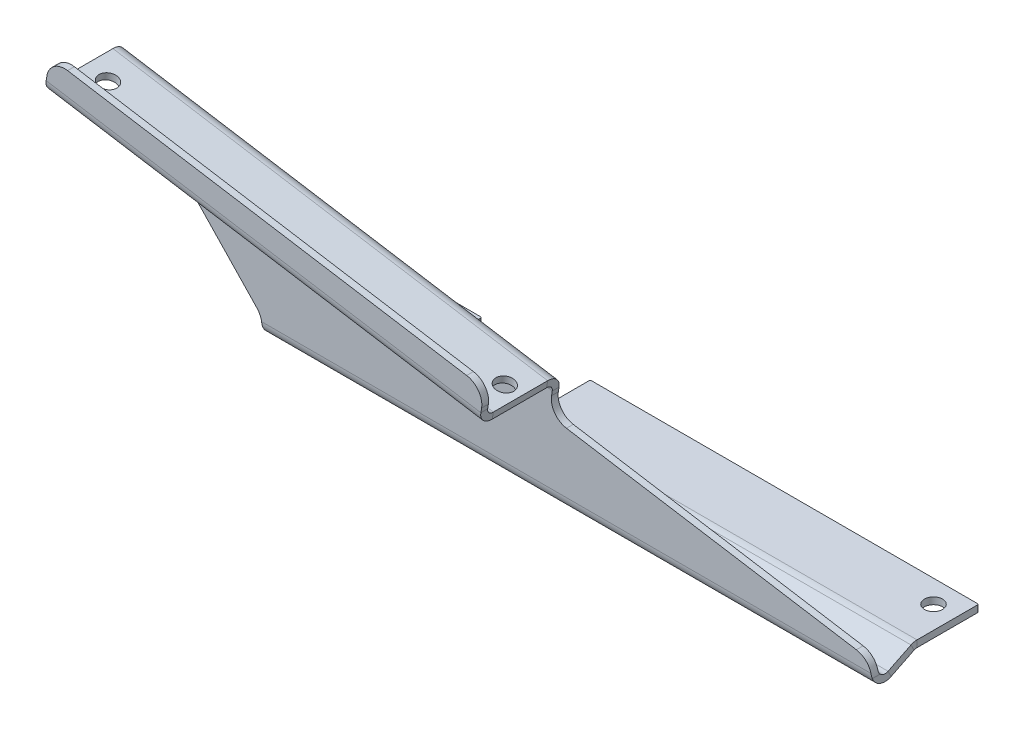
ISO-10303-21;
HEADER;
FILE_DESCRIPTION(('STEP AP214'),'2;1');
FILE_NAME('part.step','',(''),(''),'','','');
FILE_SCHEMA(('AUTOMOTIVE_DESIGN { 1 0 10303 214 1 1 1 1 }'));
ENDSEC;
DATA;
#1=APPLICATION_CONTEXT('core data for automotive mechanical design processes');
#2=APPLICATION_PROTOCOL_DEFINITION('international standard','automotive_design',2000,#1);
#3=PRODUCT_CONTEXT('',#1,'mechanical');
#4=PRODUCT('Part','Part','',(#3));
#5=PRODUCT_RELATED_PRODUCT_CATEGORY('part','',(#4));
#6=PRODUCT_DEFINITION_FORMATION('','',#4);
#7=PRODUCT_DEFINITION_CONTEXT('part definition',#1,'design');
#8=PRODUCT_DEFINITION('design','',#6,#7);
#9=PRODUCT_DEFINITION_SHAPE('','',#8);
#10=(LENGTH_UNIT() NAMED_UNIT(*) SI_UNIT(.MILLI.,.METRE.));
#11=(NAMED_UNIT(*) PLANE_ANGLE_UNIT() SI_UNIT($,.RADIAN.));
#12=(NAMED_UNIT(*) SI_UNIT($,.STERADIAN.) SOLID_ANGLE_UNIT());
#13=UNCERTAINTY_MEASURE_WITH_UNIT(LENGTH_MEASURE(1.E-05),#10,'distance_accuracy_value','');
#14=(GEOMETRIC_REPRESENTATION_CONTEXT(3) GLOBAL_UNCERTAINTY_ASSIGNED_CONTEXT((#13)) GLOBAL_UNIT_ASSIGNED_CONTEXT((#10,
#11,#12)) REPRESENTATION_CONTEXT('',''));
#15=CARTESIAN_POINT('',(0.,0.,0.));
#16=DIRECTION('',(0.,0.,1.));
#17=DIRECTION('',(1.,0.,0.));
#18=AXIS2_PLACEMENT_3D('',#15,#16,#17);
#19=CARTESIAN_POINT('',(-428.625,9.525,-70.5485));
#20=DIRECTION('',(0.,0.,-1.));
#21=DIRECTION('',(1.,0.,0.));
#22=AXIS2_PLACEMENT_3D('',#19,#20,#21);
#23=PLANE('',#22);
#24=DIRECTION('',(1.,0.,0.));
#25=VECTOR('',#24,1.);
#26=CARTESIAN_POINT('',(-428.625,9.525,-70.5485));
#27=LINE('',#26,#25);
#28=CARTESIAN_POINT('',(-272.25625,9.525,-70.5485));
#29=VERTEX_POINT('',#28);
#30=CARTESIAN_POINT('',(-0.793749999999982,9.525,-70.5485));
#31=VERTEX_POINT('',#30);
#32=EDGE_CURVE('E686',#29,#31,#27,.T.);
#33=ORIENTED_EDGE('',*,*,#32,.F.);
#34=DIRECTION('',(0.,-1.,0.));
#35=VECTOR('',#34,1.);
#36=CARTESIAN_POINT('',(-272.25625,9.525,-70.5485));
#37=LINE('',#36,#35);
#38=CARTESIAN_POINT('',(-272.25625,14.2875,-70.5485));
#39=VERTEX_POINT('',#38);
#40=EDGE_CURVE('E654',#29,#39,#37,.F.);
#41=ORIENTED_EDGE('',*,*,#40,.T.);
#42=DIRECTION('',(1.,0.,0.));
#43=VECTOR('',#42,1.);
#44=CARTESIAN_POINT('',(-428.625,14.2875,-70.5485));
#45=LINE('',#44,#43);
#46=CARTESIAN_POINT('',(-0.793749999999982,14.2875,-70.5485));
#47=VERTEX_POINT('',#46);
#48=EDGE_CURVE('E701',#39,#47,#45,.T.);
#49=ORIENTED_EDGE('',*,*,#48,.T.);
#50=DIRECTION('',(0.,-1.,0.));
#51=VECTOR('',#50,1.);
#52=CARTESIAN_POINT('',(-0.793749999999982,9.525,-70.5485));
#53=LINE('',#52,#51);
#54=EDGE_CURVE('E652',#47,#31,#53,.T.);
#55=ORIENTED_EDGE('',*,*,#54,.T.);
#56=EDGE_LOOP('',(#33,#41,#49,#55));
#57=FACE_BOUND('',#56,.T.);
#58=ADVANCED_FACE('F78',(#57),#23,.T.);
#59=CARTESIAN_POINT('',(0.,0.,4.7625));
#60=DIRECTION('',(0.,0.,1.));
#61=DIRECTION('',(1.,0.,0.));
#62=AXIS2_PLACEMENT_3D('',#59,#60,#61);
#63=PLANE('',#62);
#64=DIRECTION('',(-0.9871793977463,0.159614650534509,0.));
#65=VECTOR('',#64,1.);
#66=CARTESIAN_POINT('',(-530.037763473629,118.977822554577,4.76250000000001));
#67=LINE('',#66,#65);
#68=CARTESIAN_POINT('',(-528.794946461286,118.776874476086,4.7625));
#69=VERTEX_POINT('',#68);
#70=CARTESIAN_POINT('',(-224.44404115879,69.5671122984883,4.7625));
#71=VERTEX_POINT('',#70);
#72=EDGE_CURVE('E480',#69,#71,#67,.F.);
#73=ORIENTED_EDGE('',*,*,#72,.F.);
#74=CARTESIAN_POINT('',(-519.879476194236,122.129487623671,4.7625));
#75=DIRECTION('',(0.,0.,1.));
#76=DIRECTION('',(1.,0.,0.));
#77=AXIS2_PLACEMENT_3D('',#74,#75,#76);
#78=CIRCLE('',#77,9.525);
#79=CARTESIAN_POINT('',(-526.770546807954,115.553868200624,4.7625));
#80=VERTEX_POINT('',#79);
#81=EDGE_CURVE('E639',#69,#80,#78,.T.);
#82=ORIENTED_EDGE('',*,*,#81,.T.);
#83=DIRECTION('',(-0.690353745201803,0.723471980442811,0.));
#84=VECTOR('',#83,1.);
#85=CARTESIAN_POINT('',(-428.625,12.7,4.7625));
#86=LINE('',#85,#84);
#87=CARTESIAN_POINT('',(-432.136905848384,16.3803819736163,4.7625));
#88=VERTEX_POINT('',#87);
#89=EDGE_CURVE('E494',#88,#80,#86,.T.);
#90=ORIENTED_EDGE('',*,*,#89,.F.);
#91=CARTESIAN_POINT('',(-441.325000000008,7.61288940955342,4.7625));
#92=DIRECTION('',(0.,0.,1.));
#93=DIRECTION('',(1.,0.,0.));
#94=AXIS2_PLACEMENT_3D('',#91,#92,#93);
#95=CIRCLE('',#94,12.7);
#96=CARTESIAN_POINT('',(-428.783297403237,9.61181311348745,4.7625));
#97=VERTEX_POINT('',#96);
#98=EDGE_CURVE('E603',#88,#97,#95,.F.);
#99=ORIENTED_EDGE('',*,*,#98,.T.);
#100=DIRECTION('',(1.,0.,0.));
#101=VECTOR('',#100,1.);
#102=CARTESIAN_POINT('',(-2571.75,9.61181311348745,4.7625));
#103=LINE('',#102,#101);
#104=CARTESIAN_POINT('',(-0.416871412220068,9.61181311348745,4.7625));
#105=VERTEX_POINT('',#104);
#106=EDGE_CURVE('E735',#97,#105,#103,.T.);
#107=ORIENTED_EDGE('',*,*,#106,.T.);
#108=CARTESIAN_POINT('',(-12.7,6.38462360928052,4.7625));
#109=DIRECTION('',(0.,0.,1.));
#110=DIRECTION('',(1.,0.,0.));
#111=AXIS2_PLACEMENT_3D('',#108,#109,#110);
#112=CIRCLE('',#111,12.7);
#113=CARTESIAN_POINT('',(-10.6728939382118,18.9218019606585,4.7625));
#114=VERTEX_POINT('',#113);
#115=EDGE_CURVE('E587',#105,#114,#112,.T.);
#116=ORIENTED_EDGE('',*,*,#115,.T.);
#117=DIRECTION('',(0.9871793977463,-0.159614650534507,0.));
#118=VECTOR('',#117,1.);
#119=CARTESIAN_POINT('',(0.,17.1961275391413,4.7625));
#120=LINE('',#119,#118);
#121=CARTESIAN_POINT('',(-214.440745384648,51.8685332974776,4.7625));
#122=VERTEX_POINT('',#121);
#123=EDGE_CURVE('E491',#122,#114,#120,.T.);
#124=ORIENTED_EDGE('',*,*,#123,.F.);
#125=CARTESIAN_POINT('',(-212.413639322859,64.4057116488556,4.7625));
#126=DIRECTION('',(0.,0.,1.));
#127=DIRECTION('',(1.,0.,0.));
#128=AXIS2_PLACEMENT_3D('',#125,#126,#127);
#129=CIRCLE('',#128,12.7);
#130=CARTESIAN_POINT('',(-224.950817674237,66.4328177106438,4.7625));
#131=VERTEX_POINT('',#130);
#132=EDGE_CURVE('E779',#122,#131,#129,.F.);
#133=ORIENTED_EDGE('',*,*,#132,.T.);
#134=DIRECTION('',(-0.159614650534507,-0.9871793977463,0.));
#135=VECTOR('',#134,1.);
#136=CARTESIAN_POINT('',(-226.977923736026,53.8956393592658,4.7625));
#137=LINE('',#136,#135);
#138=EDGE_CURVE('E486',#71,#131,#137,.T.);
#139=ORIENTED_EDGE('',*,*,#138,.F.);
#140=EDGE_LOOP('',(#73,#82,#90,#99,#107,#116,#124,#133,#139));
#141=FACE_BOUND('',#140,.T.);
#142=ADVANCED_FACE('F792',(#141),#63,.T.);
#143=CARTESIAN_POINT('',(0.,0.,0.));
#144=DIRECTION('',(0.,0.,1.));
#145=DIRECTION('',(1.,0.,0.));
#146=AXIS2_PLACEMENT_3D('',#143,#144,#145);
#147=PLANE('',#146);
#148=DIRECTION('',(-0.690353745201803,0.723471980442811,0.));
#149=VECTOR('',#148,1.);
#150=CARTESIAN_POINT('',(-428.625,12.7,0.));
#151=LINE('',#150,#149);
#152=CARTESIAN_POINT('',(-432.136905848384,16.3803819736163,0.));
#153=VERTEX_POINT('',#152);
#154=CARTESIAN_POINT('',(-526.770546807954,115.553868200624,0.));
#155=VERTEX_POINT('',#154);
#156=EDGE_CURVE('E499',#153,#155,#151,.T.);
#157=ORIENTED_EDGE('',*,*,#156,.T.);
#158=CARTESIAN_POINT('',(-519.879476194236,122.129487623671,0.));
#159=DIRECTION('',(0.,0.,1.));
#160=DIRECTION('',(1.,0.,0.));
#161=AXIS2_PLACEMENT_3D('',#158,#159,#160);
#162=CIRCLE('',#161,9.525);
#163=CARTESIAN_POINT('',(-528.794946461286,118.776874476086,0.));
#164=VERTEX_POINT('',#163);
#165=EDGE_CURVE('E607',#155,#164,#162,.F.);
#166=ORIENTED_EDGE('',*,*,#165,.T.);
#167=DIRECTION('',(-0.9871793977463,0.159614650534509,0.));
#168=VECTOR('',#167,1.);
#169=CARTESIAN_POINT('',(-530.037763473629,118.977822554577,0.));
#170=LINE('',#169,#168);
#171=CARTESIAN_POINT('',(-224.44404115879,69.5671122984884,0.));
#172=VERTEX_POINT('',#171);
#173=EDGE_CURVE('E468',#164,#172,#170,.F.);
#174=ORIENTED_EDGE('',*,*,#173,.T.);
#175=DIRECTION('',(-0.159614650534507,-0.9871793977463,0.));
#176=VECTOR('',#175,1.);
#177=CARTESIAN_POINT('',(-226.977923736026,53.8956393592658,0.));
#178=LINE('',#177,#176);
#179=CARTESIAN_POINT('',(-224.950817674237,66.4328177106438,0.));
#180=VERTEX_POINT('',#179);
#181=EDGE_CURVE('E487',#172,#180,#178,.T.);
#182=ORIENTED_EDGE('',*,*,#181,.T.);
#183=CARTESIAN_POINT('',(-212.413639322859,64.4057116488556,0.));
#184=DIRECTION('',(0.,0.,1.));
#185=DIRECTION('',(1.,0.,0.));
#186=AXIS2_PLACEMENT_3D('',#183,#184,#185);
#187=CIRCLE('',#186,12.7);
#188=CARTESIAN_POINT('',(-214.440745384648,51.8685332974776,0.));
#189=VERTEX_POINT('',#188);
#190=EDGE_CURVE('E781',#180,#189,#187,.T.);
#191=ORIENTED_EDGE('',*,*,#190,.T.);
#192=DIRECTION('',(0.9871793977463,-0.159614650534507,0.));
#193=VECTOR('',#192,1.);
#194=CARTESIAN_POINT('',(0.,17.1961275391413,0.));
#195=LINE('',#194,#193);
#196=CARTESIAN_POINT('',(-10.6728939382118,18.9218019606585,0.));
#197=VERTEX_POINT('',#196);
#198=EDGE_CURVE('E490',#189,#197,#195,.T.);
#199=ORIENTED_EDGE('',*,*,#198,.T.);
#200=CARTESIAN_POINT('',(-12.7,6.38462360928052,0.));
#201=DIRECTION('',(0.,0.,1.));
#202=DIRECTION('',(1.,0.,0.));
#203=AXIS2_PLACEMENT_3D('',#200,#201,#202);
#204=CIRCLE('',#203,12.7);
#205=CARTESIAN_POINT('',(-0.416871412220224,9.61181311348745,0.));
#206=VERTEX_POINT('',#205);
#207=EDGE_CURVE('E555',#197,#206,#204,.F.);
#208=ORIENTED_EDGE('',*,*,#207,.T.);
#209=DIRECTION('',(1.,0.,0.));
#210=VECTOR('',#209,1.);
#211=CARTESIAN_POINT('',(-2571.75,9.61181311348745,0.));
#212=LINE('',#211,#210);
#213=CARTESIAN_POINT('',(-428.783297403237,9.61181311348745,0.));
#214=VERTEX_POINT('',#213);
#215=EDGE_CURVE('E346',#214,#206,#212,.T.);
#216=ORIENTED_EDGE('',*,*,#215,.F.);
#217=CARTESIAN_POINT('',(-441.325000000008,7.61288940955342,0.));
#218=DIRECTION('',(0.,0.,1.));
#219=DIRECTION('',(1.,0.,0.));
#220=AXIS2_PLACEMENT_3D('',#217,#218,#219);
#221=CIRCLE('',#220,12.7);
#222=EDGE_CURVE('E778',#214,#153,#221,.T.);
#223=ORIENTED_EDGE('',*,*,#222,.T.);
#224=EDGE_LOOP('',(#157,#166,#174,#182,#191,#199,#208,#216,#223));
#225=FACE_BOUND('',#224,.T.);
#226=ADVANCED_FACE('F800',(#225),#147,.F.);
#227=CARTESIAN_POINT('',(-222.923711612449,78.969996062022,57.2262));
#228=DIRECTION('',(0.9871793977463,-0.159614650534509,0.));
#229=DIRECTION('',(0.159614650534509,0.9871793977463,0.));
#230=AXIS2_PLACEMENT_3D('',#227,#228,#229);
#231=PLANE('',#230);
#232=DIRECTION('',(0.,0.,-1.));
#233=VECTOR('',#232,1.);
#234=CARTESIAN_POINT('',(-222.923711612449,78.969996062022,57.2262));
#235=LINE('',#234,#233);
#236=CARTESIAN_POINT('',(-222.923711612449,78.9699960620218,9.52499999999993));
#237=VERTEX_POINT('',#236);
#238=CARTESIAN_POINT('',(-222.923711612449,78.9699960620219,47.7012));
#239=VERTEX_POINT('',#238);
#240=EDGE_CURVE('E450',#237,#239,#235,.F.);
#241=ORIENTED_EDGE('',*,*,#240,.T.);
#242=DIRECTION('',(-0.159614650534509,-0.987179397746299,0.));
#243=VECTOR('',#242,1.);
#244=CARTESIAN_POINT('',(-222.923711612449,78.9699960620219,47.7012));
#245=LINE('',#244,#243);
#246=CARTESIAN_POINT('',(-223.68387638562,74.2685541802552,47.7012));
#247=VERTEX_POINT('',#246);
#248=EDGE_CURVE('E431',#239,#247,#245,.T.);
#249=ORIENTED_EDGE('',*,*,#248,.T.);
#250=DIRECTION('',(0.,0.,1.));
#251=VECTOR('',#250,1.);
#252=CARTESIAN_POINT('',(-223.68387638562,74.2685541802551,4.7625));
#253=LINE('',#252,#251);
#254=CARTESIAN_POINT('',(-223.68387638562,74.2685541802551,9.52499999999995));
#255=VERTEX_POINT('',#254);
#256=EDGE_CURVE('E455',#255,#247,#253,.T.);
#257=ORIENTED_EDGE('',*,*,#256,.F.);
#258=DIRECTION('',(0.159614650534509,0.9871793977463,0.));
#259=VECTOR('',#258,1.);
#260=CARTESIAN_POINT('',(-222.923711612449,78.9699960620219,9.52499999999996));
#261=LINE('',#260,#259);
#262=EDGE_CURVE('E444',#255,#237,#261,.T.);
#263=ORIENTED_EDGE('',*,*,#262,.T.);
#264=EDGE_LOOP('',(#241,#249,#257,#263));
#265=FACE_BOUND('',#264,.T.);
#266=ADVANCED_FACE('F626',(#265),#231,.T.);
#267=CARTESIAN_POINT('',(-222.923711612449,78.9699960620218,4.76249999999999));
#268=DIRECTION('',(-0.159614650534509,-0.9871793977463,0.));
#269=DIRECTION('',(0.9871793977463,-0.159614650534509,0.));
#270=AXIS2_PLACEMENT_3D('',#267,#268,#269);
#271=PLANE('',#270);
#272=CARTESIAN_POINT('',(-512.845960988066,125.846823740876,28.6511999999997));
#273=DIRECTION('',(0.159614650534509,0.9871793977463,0.));
#274=DIRECTION('',(-0.987179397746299,0.159614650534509,0.));
#275=AXIS2_PLACEMENT_3D('',#272,#273,#274);
#276=CIRCLE('',#275,6.34999999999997);
#277=CARTESIAN_POINT('',(-519.114550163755,126.86037677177,28.6511999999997));
#278=VERTEX_POINT('',#277);
#279=EDGE_CURVE('E1318',#278,#278,#276,.T.);
#280=ORIENTED_EDGE('',*,*,#279,.F.);
#281=EDGE_LOOP('',(#280));
#282=FACE_BOUND('',#281,.T.);
#283=CARTESIAN_POINT('',(-233.893742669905,80.7437138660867,28.6511999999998));
#284=DIRECTION('',(0.159614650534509,0.9871793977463,0.));
#285=DIRECTION('',(-0.987179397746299,0.159614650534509,0.));
#286=AXIS2_PLACEMENT_3D('',#283,#284,#285);
#287=CIRCLE('',#286,6.35);
#288=CARTESIAN_POINT('',(-240.162331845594,81.7572668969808,28.6511999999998));
#289=VERTEX_POINT('',#288);
#290=EDGE_CURVE('E1312',#289,#289,#287,.T.);
#291=ORIENTED_EDGE('',*,*,#290,.F.);
#292=EDGE_LOOP('',(#291));
#293=FACE_BOUND('',#292,.T.);
#294=DIRECTION('',(0.987179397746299,-0.159614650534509,0.));
#295=VECTOR('',#294,1.);
#296=CARTESIAN_POINT('',(-222.923711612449,78.9699960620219,47.7012));
#297=LINE('',#296,#295);
#298=CARTESIAN_POINT('',(-528.517433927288,128.380706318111,47.7012));
#299=VERTEX_POINT('',#298);
#300=EDGE_CURVE('E437',#239,#299,#297,.F.);
#301=ORIENTED_EDGE('',*,*,#300,.F.);
#302=ORIENTED_EDGE('',*,*,#240,.F.);
#303=DIRECTION('',(-0.9871793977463,0.159614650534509,0.));
#304=VECTOR('',#303,1.);
#305=CARTESIAN_POINT('',(-222.923711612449,78.9699960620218,9.52499999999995));
#306=LINE('',#305,#304);
#307=CARTESIAN_POINT('',(-528.517433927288,128.380706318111,9.52499999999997));
#308=VERTEX_POINT('',#307);
#309=EDGE_CURVE('E458',#308,#237,#306,.F.);
#310=ORIENTED_EDGE('',*,*,#309,.F.);
#311=DIRECTION('',(0.,0.,1.));
#312=VECTOR('',#311,1.);
#313=CARTESIAN_POINT('',(-528.517433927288,128.380706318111,4.76249999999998));
#314=LINE('',#313,#312);
#315=EDGE_CURVE('E447',#299,#308,#314,.F.);
#316=ORIENTED_EDGE('',*,*,#315,.F.);
#317=EDGE_LOOP('',(#301,#302,#310,#316));
#318=FACE_BOUND('',#317,.T.);
#319=ADVANCED_FACE('F838',(#282,#293,#318),#271,.F.);
#320=CARTESIAN_POINT('',(-223.68387638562,74.2685541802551,4.7625));
#321=DIRECTION('',(-0.159614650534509,-0.9871793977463,0.));
#322=DIRECTION('',(0.9871793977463,-0.159614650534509,0.));
#323=AXIS2_PLACEMENT_3D('',#320,#321,#322);
#324=PLANE('',#323);
#325=CARTESIAN_POINT('',(-513.606125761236,121.145381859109,28.6511999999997));
#326=DIRECTION('',(0.159614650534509,0.9871793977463,0.));
#327=DIRECTION('',(-0.987179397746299,0.159614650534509,0.));
#328=AXIS2_PLACEMENT_3D('',#325,#326,#327);
#329=CIRCLE('',#328,6.34999999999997);
#330=CARTESIAN_POINT('',(-519.874714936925,122.158934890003,28.6511999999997));
#331=VERTEX_POINT('',#330);
#332=EDGE_CURVE('E1315',#331,#331,#329,.T.);
#333=ORIENTED_EDGE('',*,*,#332,.T.);
#334=EDGE_LOOP('',(#333));
#335=FACE_BOUND('',#334,.T.);
#336=CARTESIAN_POINT('',(-234.653907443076,76.0422719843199,28.6511999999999));
#337=DIRECTION('',(0.159614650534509,0.9871793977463,0.));
#338=DIRECTION('',(-0.987179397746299,0.159614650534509,0.));
#339=AXIS2_PLACEMENT_3D('',#336,#337,#338);
#340=CIRCLE('',#339,6.35);
#341=CARTESIAN_POINT('',(-240.922496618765,77.0558250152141,28.6511999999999));
#342=VERTEX_POINT('',#341);
#343=EDGE_CURVE('E1309',#342,#342,#340,.T.);
#344=ORIENTED_EDGE('',*,*,#343,.T.);
#345=EDGE_LOOP('',(#344));
#346=FACE_BOUND('',#345,.T.);
#347=ORIENTED_EDGE('',*,*,#256,.T.);
#348=DIRECTION('',(0.987179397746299,-0.159614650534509,0.));
#349=VECTOR('',#348,1.);
#350=CARTESIAN_POINT('',(-223.68387638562,74.2685541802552,47.7012));
#351=LINE('',#350,#349);
#352=CARTESIAN_POINT('',(-529.277598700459,123.679264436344,47.7012));
#353=VERTEX_POINT('',#352);
#354=EDGE_CURVE('E424',#247,#353,#351,.F.);
#355=ORIENTED_EDGE('',*,*,#354,.T.);
#356=DIRECTION('',(0.,0.,-1.));
#357=VECTOR('',#356,1.);
#358=CARTESIAN_POINT('',(-529.277598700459,123.679264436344,4.76250000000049));
#359=LINE('',#358,#357);
#360=CARTESIAN_POINT('',(-529.277598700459,123.679264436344,9.525));
#361=VERTEX_POINT('',#360);
#362=EDGE_CURVE('E453',#353,#361,#359,.T.);
#363=ORIENTED_EDGE('',*,*,#362,.T.);
#364=DIRECTION('',(-0.9871793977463,0.159614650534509,0.));
#365=VECTOR('',#364,1.);
#366=CARTESIAN_POINT('',(-223.68387638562,74.2685541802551,9.52499999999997));
#367=LINE('',#366,#365);
#368=EDGE_CURVE('E463',#255,#361,#367,.T.);
#369=ORIENTED_EDGE('',*,*,#368,.F.);
#370=EDGE_LOOP('',(#347,#355,#363,#369));
#371=FACE_BOUND('',#370,.T.);
#372=ADVANCED_FACE('F822',(#335,#346,#371),#324,.T.);
#373=CARTESIAN_POINT('',(-428.625,12.7,4.7625));
#374=DIRECTION('',(0.723471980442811,0.690353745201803,0.));
#375=DIRECTION('',(-0.690353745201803,0.723471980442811,0.));
#376=AXIS2_PLACEMENT_3D('',#373,#374,#375);
#377=PLANE('',#376);
#378=ORIENTED_EDGE('',*,*,#89,.T.);
#379=DIRECTION('',(0.,0.,1.));
#380=VECTOR('',#379,1.);
#381=CARTESIAN_POINT('',(-526.770546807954,115.553868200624,4.76250000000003));
#382=LINE('',#381,#380);
#383=EDGE_CURVE('E602',#80,#155,#382,.F.);
#384=ORIENTED_EDGE('',*,*,#383,.T.);
#385=ORIENTED_EDGE('',*,*,#156,.F.);
#386=DIRECTION('',(0.,0.,-1.));
#387=VECTOR('',#386,1.);
#388=CARTESIAN_POINT('',(-432.136905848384,16.3803819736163,4.7625));
#389=LINE('',#388,#387);
#390=EDGE_CURVE('E553',#153,#88,#389,.F.);
#391=ORIENTED_EDGE('',*,*,#390,.T.);
#392=EDGE_LOOP('',(#378,#384,#385,#391));
#393=FACE_BOUND('',#392,.T.);
#394=ADVANCED_FACE('F804',(#393),#377,.F.);
#395=CARTESIAN_POINT('',(-226.977923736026,53.8956393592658,4.7625));
#396=DIRECTION('',(-0.9871793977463,0.159614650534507,0.));
#397=DIRECTION('',(-0.159614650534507,-0.9871793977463,0.));
#398=AXIS2_PLACEMENT_3D('',#395,#396,#397);
#399=PLANE('',#398);
#400=ORIENTED_EDGE('',*,*,#138,.T.);
#401=DIRECTION('',(0.,0.,1.));
#402=VECTOR('',#401,1.);
#403=CARTESIAN_POINT('',(-224.950817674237,66.4328177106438,0.));
#404=LINE('',#403,#402);
#405=EDGE_CURVE('E542',#131,#180,#404,.F.);
#406=ORIENTED_EDGE('',*,*,#405,.T.);
#407=ORIENTED_EDGE('',*,*,#181,.F.);
#408=DIRECTION('',(0.,0.,-1.));
#409=VECTOR('',#408,1.);
#410=CARTESIAN_POINT('',(-224.44404115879,69.5671122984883,4.76249999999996));
#411=LINE('',#410,#409);
#412=EDGE_CURVE('E474',#71,#172,#411,.T.);
#413=ORIENTED_EDGE('',*,*,#412,.F.);
#414=EDGE_LOOP('',(#400,#406,#407,#413));
#415=FACE_BOUND('',#414,.T.);
#416=ADVANCED_FACE('F846',(#415),#399,.F.);
#417=CARTESIAN_POINT('',(0.,17.1961275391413,4.7625));
#418=DIRECTION('',(-0.159614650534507,-0.9871793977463,0.));
#419=DIRECTION('',(0.9871793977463,-0.159614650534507,0.));
#420=AXIS2_PLACEMENT_3D('',#417,#418,#419);
#421=PLANE('',#420);
#422=ORIENTED_EDGE('',*,*,#198,.F.);
#423=DIRECTION('',(0.,0.,1.));
#424=VECTOR('',#423,1.);
#425=CARTESIAN_POINT('',(-214.440745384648,51.8685332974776,4.7625));
#426=LINE('',#425,#424);
#427=EDGE_CURVE('E548',#189,#122,#426,.T.);
#428=ORIENTED_EDGE('',*,*,#427,.T.);
#429=ORIENTED_EDGE('',*,*,#123,.T.);
#430=DIRECTION('',(0.,0.,-1.));
#431=VECTOR('',#430,1.);
#432=CARTESIAN_POINT('',(-10.6728939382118,18.9218019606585,0.));
#433=LINE('',#432,#431);
#434=EDGE_CURVE('E545',#114,#197,#433,.T.);
#435=ORIENTED_EDGE('',*,*,#434,.T.);
#436=EDGE_LOOP('',(#422,#428,#429,#435));
#437=FACE_BOUND('',#436,.T.);
#438=ADVANCED_FACE('F797',(#437),#421,.F.);
#439=CARTESIAN_POINT('',(-224.44404115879,69.5671122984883,9.52499999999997));
#440=DIRECTION('',(0.9871793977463,-0.159614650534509,0.));
#441=DIRECTION('',(0.159614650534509,0.987179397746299,0.));
#442=AXIS2_PLACEMENT_3D('',#439,#440,#441);
#443=PLANE('',#442);
#444=ORIENTED_EDGE('',*,*,#262,.F.);
#445=CARTESIAN_POINT('',(-224.44404115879,69.5671122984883,9.52499999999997));
#446=DIRECTION('',(-0.9871793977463,0.159614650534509,0.));
#447=DIRECTION('',(-0.159614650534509,-0.987179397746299,0.));
#448=AXIS2_PLACEMENT_3D('',#445,#446,#447);
#449=CIRCLE('',#448,4.76250000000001);
#450=EDGE_CURVE('E477',#71,#255,#449,.F.);
#451=ORIENTED_EDGE('',*,*,#450,.F.);
#452=ORIENTED_EDGE('',*,*,#412,.T.);
#453=CARTESIAN_POINT('',(-224.44404115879,69.5671122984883,9.52499999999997));
#454=DIRECTION('',(-0.9871793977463,0.159614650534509,0.));
#455=DIRECTION('',(-0.159614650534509,-0.987179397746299,0.));
#456=AXIS2_PLACEMENT_3D('',#453,#454,#455);
#457=CIRCLE('',#456,9.52500000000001);
#458=EDGE_CURVE('E470',#172,#237,#457,.F.);
#459=ORIENTED_EDGE('',*,*,#458,.T.);
#460=EDGE_LOOP('',(#444,#451,#452,#459));
#461=FACE_BOUND('',#460,.T.);
#462=ADVANCED_FACE('F625',(#461),#443,.T.);
#463=CARTESIAN_POINT('',(-530.037763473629,118.977822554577,9.52500000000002));
#464=DIRECTION('',(0.9871793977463,-0.159614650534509,0.));
#465=DIRECTION('',(0.159614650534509,0.987179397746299,0.));
#466=AXIS2_PLACEMENT_3D('',#463,#464,#465);
#467=PLANE('',#466);
#468=CARTESIAN_POINT('',(-530.037763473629,118.977822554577,9.52500000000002));
#469=DIRECTION('',(-0.9871793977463,0.159614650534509,0.));
#470=DIRECTION('',(-0.159614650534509,-0.987179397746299,0.));
#471=AXIS2_PLACEMENT_3D('',#468,#469,#470);
#472=CIRCLE('',#471,9.52500000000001);
#473=CARTESIAN_POINT('',(-529.28235995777,123.649817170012,1.25895760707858));
#474=VERTEX_POINT('',#473);
#475=EDGE_CURVE('E471',#308,#474,#472,.T.);
#476=ORIENTED_EDGE('',*,*,#475,.T.);
#477=DIRECTION('',(0.,0.,1.));
#478=VECTOR('',#477,1.);
#479=CARTESIAN_POINT('',(-529.28235995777,123.649817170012,9.52500000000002));
#480=LINE('',#479,#478);
#481=CARTESIAN_POINT('',(-529.28235995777,123.649817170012,8.99279882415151));
#482=VERTEX_POINT('',#481);
#483=EDGE_CURVE('E615',#474,#482,#480,.T.);
#484=ORIENTED_EDGE('',*,*,#483,.T.);
#485=CARTESIAN_POINT('',(-530.037763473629,118.977822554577,9.52500000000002));
#486=DIRECTION('',(-0.9871793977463,0.159614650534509,0.));
#487=DIRECTION('',(-0.159614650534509,-0.987179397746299,0.));
#488=AXIS2_PLACEMENT_3D('',#485,#486,#487);
#489=CIRCLE('',#488,4.76250000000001);
#490=EDGE_CURVE('E449',#361,#482,#489,.T.);
#491=ORIENTED_EDGE('',*,*,#490,.F.);
#492=DIRECTION('',(0.159614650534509,0.9871793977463,0.));
#493=VECTOR('',#492,1.);
#494=CARTESIAN_POINT('',(-529.277598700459,123.679264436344,9.52499999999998));
#495=LINE('',#494,#493);
#496=EDGE_CURVE('E460',#361,#308,#495,.T.);
#497=ORIENTED_EDGE('',*,*,#496,.T.);
#498=EDGE_LOOP('',(#476,#484,#491,#497));
#499=FACE_BOUND('',#498,.T.);
#500=ADVANCED_FACE('F623',(#499),#467,.F.);
#501=CARTESIAN_POINT('',(-530.037763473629,118.977822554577,9.52500000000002));
#502=DIRECTION('',(-0.9871793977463,0.159614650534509,0.));
#503=DIRECTION('',(0.159614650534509,0.987179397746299,0.));
#504=AXIS2_PLACEMENT_3D('',#501,#502,#503);
#505=CYLINDRICAL_SURFACE('',#504,9.52500000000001);
#506=ORIENTED_EDGE('',*,*,#173,.F.);
#507=CARTESIAN_POINT('',(-528.794946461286,118.776874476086,0.));
#508=CARTESIAN_POINT('',(-528.865985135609,118.965676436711,-3.00734692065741E-05));
#509=CARTESIAN_POINT('',(-528.93097106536,119.156801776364,0.00482454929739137));
#510=CARTESIAN_POINT('',(-529.048593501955,119.542336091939,0.0251651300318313));
#511=CARTESIAN_POINT('',(-529.101225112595,119.736746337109,0.040655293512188));
#512=CARTESIAN_POINT('',(-529.193829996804,120.127300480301,0.083126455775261));
#513=CARTESIAN_POINT('',(-529.23380554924,120.323444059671,0.110105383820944));
#514=CARTESIAN_POINT('',(-529.30108974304,120.715831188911,0.17614294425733));
#515=CARTESIAN_POINT('',(-529.328401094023,120.912074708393,0.215198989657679));
#516=CARTESIAN_POINT('',(-529.370647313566,121.303554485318,0.305871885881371));
#517=CARTESIAN_POINT('',(-529.385548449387,121.498786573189,0.357522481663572));
#518=CARTESIAN_POINT('',(-529.40333700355,121.886033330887,0.473422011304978));
#519=CARTESIAN_POINT('',(-529.406224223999,122.078047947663,0.537671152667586));
#520=CARTESIAN_POINT('',(-529.400729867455,122.456846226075,0.67844045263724));
#521=CARTESIAN_POINT('',(-529.392373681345,122.643640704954,0.754932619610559));
#522=CARTESIAN_POINT('',(-529.365384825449,123.010994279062,0.919891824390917));
#523=CARTESIAN_POINT('',(-529.346758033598,123.191556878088,1.0083519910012));
#524=CARTESIAN_POINT('',(-529.317333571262,123.415866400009,1.12777926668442));
#525=CARTESIAN_POINT('',(-529.310778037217,123.463062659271,1.15346046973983));
#526=CARTESIAN_POINT('',(-529.297036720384,123.556870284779,1.20561351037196));
#527=CARTESIAN_POINT('',(-529.289851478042,123.603482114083,1.23208465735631));
#528=CARTESIAN_POINT('',(-529.28235995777,123.649817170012,1.25895760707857));
#529=B_SPLINE_CURVE_WITH_KNOTS('',3,(#507,#508,#509,#510,#511,#512,#513,#514,#515,#516,#517,
#518,#519,#520,#521,#522,#523,#524,#525,#526,#527,#528),.UNSPECIFIED.,.F.,.F.,(4,2,2,2,2,2,2,2,
2,2,4),(0.,0.605075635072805,1.21039066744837,1.81559664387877,2.42067307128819,
3.02738886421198,3.63411465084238,4.23947257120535,4.84448440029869,5.00686507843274,
5.16910773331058),.UNSPECIFIED.);
#530=EDGE_CURVE('E609',#164,#474,#529,.T.);
#531=ORIENTED_EDGE('',*,*,#530,.T.);
#532=ORIENTED_EDGE('',*,*,#475,.F.);
#533=ORIENTED_EDGE('',*,*,#309,.T.);
#534=ORIENTED_EDGE('',*,*,#458,.F.);
#535=EDGE_LOOP('',(#506,#531,#532,#533,#534));
#536=FACE_BOUND('',#535,.T.);
#537=ADVANCED_FACE('F617',(#536),#505,.T.);
#538=CARTESIAN_POINT('',(-530.037763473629,118.977822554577,9.52500000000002));
#539=DIRECTION('',(-0.9871793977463,0.159614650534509,0.));
#540=DIRECTION('',(0.159614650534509,0.987179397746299,0.));
#541=AXIS2_PLACEMENT_3D('',#538,#539,#540);
#542=CYLINDRICAL_SURFACE('',#541,4.76250000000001);
#543=ORIENTED_EDGE('',*,*,#490,.T.);
#544=CARTESIAN_POINT('',(-529.28235995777,123.649817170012,8.99279882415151));
#545=CARTESIAN_POINT('',(-529.284712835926,123.635144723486,8.86052897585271));
#546=CARTESIAN_POINT('',(-529.287958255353,123.614971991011,8.72888726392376));
#547=CARTESIAN_POINT('',(-529.295908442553,123.563780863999,8.46777564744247));
#548=CARTESIAN_POINT('',(-529.300613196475,123.532762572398,8.33830572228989));
#549=CARTESIAN_POINT('',(-529.311157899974,123.460024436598,8.08241367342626));
#550=CARTESIAN_POINT('',(-529.316998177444,123.418301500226,7.95599244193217));
#551=CARTESIAN_POINT('',(-529.329347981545,123.324392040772,7.70713344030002));
#552=CARTESIAN_POINT('',(-529.335857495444,123.272205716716,7.58469559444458));
#553=CARTESIAN_POINT('',(-529.349000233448,123.157623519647,7.3445912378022));
#554=CARTESIAN_POINT('',(-529.355633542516,123.095220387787,7.2269281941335));
#555=CARTESIAN_POINT('',(-529.368389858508,122.960580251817,6.99728202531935));
#556=CARTESIAN_POINT('',(-529.374512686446,122.888339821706,6.88530089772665));
#557=CARTESIAN_POINT('',(-529.385550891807,122.734553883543,6.66796606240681));
#558=CARTESIAN_POINT('',(-529.390467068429,122.653014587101,6.56260800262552));
#559=CARTESIAN_POINT('',(-529.398370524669,122.481157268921,6.35923702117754));
#560=CARTESIAN_POINT('',(-529.401357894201,122.390839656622,6.26122375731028));
#561=CARTESIAN_POINT('',(-529.404637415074,122.203782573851,6.0749565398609));
#562=CARTESIAN_POINT('',(-529.404976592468,122.107186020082,5.98655993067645));
#563=CARTESIAN_POINT('',(-529.402402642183,121.906973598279,5.81823652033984));
#564=CARTESIAN_POINT('',(-529.399490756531,121.803360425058,5.73830649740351));
#565=CARTESIAN_POINT('',(-529.389784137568,121.589979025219,5.58743788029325));
#566=CARTESIAN_POINT('',(-529.382990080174,121.48021187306,5.5164977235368));
#567=CARTESIAN_POINT('',(-529.364963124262,121.255494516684,5.38402148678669));
#568=CARTESIAN_POINT('',(-529.353730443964,121.140544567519,5.32248494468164));
#569=CARTESIAN_POINT('',(-529.326941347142,120.911383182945,5.21144556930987));
#570=CARTESIAN_POINT('',(-529.311583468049,120.797338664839,5.16154963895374));
#571=CARTESIAN_POINT('',(-529.276080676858,120.566448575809,5.07075746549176));
#572=CARTESIAN_POINT('',(-529.255935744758,120.449602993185,5.02986125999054));
#573=CARTESIAN_POINT('',(-529.210668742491,120.214062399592,4.95702207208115));
#574=CARTESIAN_POINT('',(-529.18554507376,120.095366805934,4.92508197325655));
#575=CARTESIAN_POINT('',(-529.130263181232,119.857148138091,4.87000230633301));
#576=CARTESIAN_POINT('',(-529.100106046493,119.737625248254,4.84686083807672));
#577=CARTESIAN_POINT('',(-529.028808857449,119.476801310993,4.80563117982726));
#578=CARTESIAN_POINT('',(-528.986668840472,119.335505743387,4.78923543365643));
#579=CARTESIAN_POINT('',(-528.895739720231,119.054667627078,4.7676741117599));
#580=CARTESIAN_POINT('',(-528.846971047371,118.915121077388,4.76247482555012));
#581=CARTESIAN_POINT('',(-528.794946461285,118.776874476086,4.76250000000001));
#582=B_SPLINE_CURVE_WITH_KNOTS('',3,(#544,#545,#546,#547,#548,#549,#550,#551,#552,#553,#554,
#555,#556,#557,#558,#559,#560,#561,#562,#563,#564,#565,#566,#567,#568,#569,#570,#571,#572,#573,
#574,#575,#576,#577,#578,#579,#580,#581),.UNSPECIFIED.,.F.,.F.,(4,2,2,2,2,2,2,2,2,2,2,2,2,2,2,2,
2,2,4),(0.,0.399186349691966,0.798368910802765,1.1976669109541,1.59695731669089,
1.99653265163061,2.39624750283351,2.79569689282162,3.19512766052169,3.58744891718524,
3.97962034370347,4.37172351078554,4.76380740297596,5.13963795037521,5.51547006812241,
5.89142305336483,6.26729480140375,6.71174824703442,7.15486164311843),.UNSPECIFIED.);
#583=EDGE_CURVE('E634',#482,#69,#582,.T.);
#584=ORIENTED_EDGE('',*,*,#583,.T.);
#585=ORIENTED_EDGE('',*,*,#72,.T.);
#586=ORIENTED_EDGE('',*,*,#450,.T.);
#587=ORIENTED_EDGE('',*,*,#368,.T.);
#588=EDGE_LOOP('',(#543,#584,#585,#586,#587));
#589=FACE_BOUND('',#588,.T.);
#590=ADVANCED_FACE('F622',(#589),#542,.F.);
#591=CARTESIAN_POINT('',(-528.517433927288,128.380706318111,4.76249999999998));
#592=DIRECTION('',(-0.9871793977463,0.159614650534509,0.));
#593=DIRECTION('',(-0.159614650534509,-0.9871793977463,0.));
#594=AXIS2_PLACEMENT_3D('',#591,#592,#593);
#595=PLANE('',#594);
#596=DIRECTION('',(-0.159614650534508,-0.9871793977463,0.));
#597=VECTOR('',#596,1.);
#598=CARTESIAN_POINT('',(-528.517433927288,128.380706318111,47.7012));
#599=LINE('',#598,#597);
#600=EDGE_CURVE('E441',#299,#353,#599,.T.);
#601=ORIENTED_EDGE('',*,*,#600,.F.);
#602=ORIENTED_EDGE('',*,*,#315,.T.);
#603=ORIENTED_EDGE('',*,*,#496,.F.);
#604=ORIENTED_EDGE('',*,*,#362,.F.);
#605=EDGE_LOOP('',(#601,#602,#603,#604));
#606=FACE_BOUND('',#605,.T.);
#607=ADVANCED_FACE('F631',(#606),#595,.T.);
#608=CARTESIAN_POINT('',(-527.757269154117,133.082148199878,47.7012));
#609=DIRECTION('',(-0.987179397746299,0.159614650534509,0.));
#610=DIRECTION('',(-0.159614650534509,-0.987179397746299,0.));
#611=AXIS2_PLACEMENT_3D('',#608,#609,#610);
#612=PLANE('',#611);
#613=DIRECTION('',(0.,0.,1.));
#614=VECTOR('',#613,1.);
#615=CARTESIAN_POINT('',(-527.757269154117,133.082148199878,57.2262));
#616=LINE('',#615,#614);
#617=CARTESIAN_POINT('',(-527.757269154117,133.082148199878,52.4637));
#618=VERTEX_POINT('',#617);
#619=CARTESIAN_POINT('',(-527.757269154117,133.082148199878,57.2262));
#620=VERTEX_POINT('',#619);
#621=EDGE_CURVE('E395',#618,#620,#616,.T.);
#622=ORIENTED_EDGE('',*,*,#621,.F.);
#623=CARTESIAN_POINT('',(-527.757269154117,133.082148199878,47.7012));
#624=DIRECTION('',(0.987179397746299,-0.159614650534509,0.));
#625=DIRECTION('',(0.159614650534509,0.987179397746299,0.));
#626=AXIS2_PLACEMENT_3D('',#623,#624,#625);
#627=CIRCLE('',#626,4.7625);
#628=EDGE_CURVE('E434',#299,#618,#627,.F.);
#629=ORIENTED_EDGE('',*,*,#628,.F.);
#630=ORIENTED_EDGE('',*,*,#600,.T.);
#631=CARTESIAN_POINT('',(-527.757269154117,133.082148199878,47.7012));
#632=DIRECTION('',(0.987179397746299,-0.159614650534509,0.));
#633=DIRECTION('',(0.159614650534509,0.987179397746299,0.));
#634=AXIS2_PLACEMENT_3D('',#631,#632,#633);
#635=CIRCLE('',#634,9.525);
#636=EDGE_CURVE('E427',#353,#620,#635,.F.);
#637=ORIENTED_EDGE('',*,*,#636,.T.);
#638=EDGE_LOOP('',(#622,#629,#630,#637));
#639=FACE_BOUND('',#638,.T.);
#640=ADVANCED_FACE('F905',(#639),#612,.T.);
#641=CARTESIAN_POINT('',(-222.163546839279,83.6714379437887,47.7012));
#642=DIRECTION('',(-0.987179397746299,0.159614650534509,0.));
#643=DIRECTION('',(-0.159614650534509,-0.987179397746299,0.));
#644=AXIS2_PLACEMENT_3D('',#641,#642,#643);
#645=PLANE('',#644);
#646=CARTESIAN_POINT('',(-222.163546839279,83.6714379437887,47.7012));
#647=DIRECTION('',(0.987179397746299,-0.159614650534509,0.));
#648=DIRECTION('',(0.159614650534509,0.987179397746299,0.));
#649=AXIS2_PLACEMENT_3D('',#646,#647,#648);
#650=CIRCLE('',#649,4.7625);
#651=CARTESIAN_POINT('',(-222.163546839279,83.6714379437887,52.4637));
#652=VERTEX_POINT('',#651);
#653=EDGE_CURVE('E399',#652,#239,#650,.T.);
#654=ORIENTED_EDGE('',*,*,#653,.F.);
#655=DIRECTION('',(0.,0.,1.));
#656=VECTOR('',#655,1.);
#657=CARTESIAN_POINT('',(-222.163546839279,83.6714379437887,52.4637));
#658=LINE('',#657,#656);
#659=CARTESIAN_POINT('',(-222.163546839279,83.6714379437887,57.2262));
#660=VERTEX_POINT('',#659);
#661=EDGE_CURVE('E416',#652,#660,#658,.T.);
#662=ORIENTED_EDGE('',*,*,#661,.T.);
#663=CARTESIAN_POINT('',(-222.163546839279,83.6714379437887,47.7012));
#664=DIRECTION('',(0.987179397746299,-0.159614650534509,0.));
#665=DIRECTION('',(0.159614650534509,0.987179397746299,0.));
#666=AXIS2_PLACEMENT_3D('',#663,#664,#665);
#667=CIRCLE('',#666,9.525);
#668=EDGE_CURVE('E428',#660,#247,#667,.T.);
#669=ORIENTED_EDGE('',*,*,#668,.T.);
#670=ORIENTED_EDGE('',*,*,#248,.F.);
#671=EDGE_LOOP('',(#654,#662,#669,#670));
#672=FACE_BOUND('',#671,.T.);
#673=ADVANCED_FACE('F828',(#672),#645,.F.);
#674=CARTESIAN_POINT('',(-222.163546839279,83.6714379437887,47.7012));
#675=DIRECTION('',(0.987179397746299,-0.159614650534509,0.));
#676=DIRECTION('',(0.,0.,1.));
#677=AXIS2_PLACEMENT_3D('',#674,#675,#676);
#678=CYLINDRICAL_SURFACE('',#677,9.525);
#679=ORIENTED_EDGE('',*,*,#354,.F.);
#680=ORIENTED_EDGE('',*,*,#668,.F.);
#681=DIRECTION('',(0.9871793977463,-0.159614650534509,0.));
#682=VECTOR('',#681,1.);
#683=CARTESIAN_POINT('',(-527.757269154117,133.082148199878,57.2262));
#684=LINE('',#683,#682);
#685=EDGE_CURVE('E414',#660,#620,#684,.F.);
#686=ORIENTED_EDGE('',*,*,#685,.T.);
#687=ORIENTED_EDGE('',*,*,#636,.F.);
#688=EDGE_LOOP('',(#679,#680,#686,#687));
#689=FACE_BOUND('',#688,.T.);
#690=ADVANCED_FACE('F901',(#689),#678,.T.);
#691=CARTESIAN_POINT('',(-222.163546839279,83.6714379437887,47.7012));
#692=DIRECTION('',(0.987179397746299,-0.159614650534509,0.));
#693=DIRECTION('',(0.,0.,1.));
#694=AXIS2_PLACEMENT_3D('',#691,#692,#693);
#695=CYLINDRICAL_SURFACE('',#694,4.7625);
#696=ORIENTED_EDGE('',*,*,#300,.T.);
#697=ORIENTED_EDGE('',*,*,#628,.T.);
#698=DIRECTION('',(0.9871793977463,-0.159614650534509,0.));
#699=VECTOR('',#698,1.);
#700=CARTESIAN_POINT('',(-527.757269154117,133.082148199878,52.4637));
#701=LINE('',#700,#699);
#702=EDGE_CURVE('E419',#618,#652,#701,.T.);
#703=ORIENTED_EDGE('',*,*,#702,.T.);
#704=ORIENTED_EDGE('',*,*,#653,.T.);
#705=EDGE_LOOP('',(#696,#697,#703,#704));
#706=FACE_BOUND('',#705,.T.);
#707=ADVANCED_FACE('F833',(#706),#695,.F.);
#708=CARTESIAN_POINT('',(-222.923711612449,78.969996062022,57.2262));
#709=DIRECTION('',(0.987179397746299,-0.159614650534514,0.));
#710=DIRECTION('',(0.159614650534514,0.987179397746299,0.));
#711=AXIS2_PLACEMENT_3D('',#708,#709,#710);
#712=PLANE('',#711);
#713=DIRECTION('',(-0.159614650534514,-0.987179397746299,0.));
#714=VECTOR('',#713,1.);
#715=CARTESIAN_POINT('',(-222.923711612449,78.9699960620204,52.4637));
#716=LINE('',#715,#714);
#717=CARTESIAN_POINT('',(-221.656770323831,86.8057325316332,52.4637));
#718=VERTEX_POINT('',#717);
#719=EDGE_CURVE('E406',#718,#652,#716,.T.);
#720=ORIENTED_EDGE('',*,*,#719,.F.);
#721=DIRECTION('',(0.,0.,-1.));
#722=VECTOR('',#721,1.);
#723=CARTESIAN_POINT('',(-221.656770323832,86.8057325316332,57.2262));
#724=LINE('',#723,#722);
#725=CARTESIAN_POINT('',(-221.656770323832,86.8057325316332,57.2262));
#726=VERTEX_POINT('',#725);
#727=EDGE_CURVE('E533',#718,#726,#724,.F.);
#728=ORIENTED_EDGE('',*,*,#727,.T.);
#729=DIRECTION('',(0.159614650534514,0.987179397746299,0.));
#730=VECTOR('',#729,1.);
#731=CARTESIAN_POINT('',(-222.923711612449,78.969996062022,57.2262));
#732=LINE('',#731,#730);
#733=EDGE_CURVE('E397',#726,#660,#732,.F.);
#734=ORIENTED_EDGE('',*,*,#733,.T.);
#735=ORIENTED_EDGE('',*,*,#661,.F.);
#736=EDGE_LOOP('',(#720,#728,#734,#735));
#737=FACE_BOUND('',#736,.T.);
#738=ADVANCED_FACE('F891',(#737),#712,.T.);
#739=CARTESIAN_POINT('',(-525.223386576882,148.7536211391,57.2262));
#740=DIRECTION('',(-0.987179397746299,0.15961465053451,0.));
#741=DIRECTION('',(-0.15961465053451,-0.987179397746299,0.));
#742=AXIS2_PLACEMENT_3D('',#739,#740,#741);
#743=PLANE('',#742);
#744=DIRECTION('',(-0.15961465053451,-0.987179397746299,0.));
#745=VECTOR('',#744,1.);
#746=CARTESIAN_POINT('',(-525.223386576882,148.7536211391,57.2262));
#747=LINE('',#746,#745);
#748=CARTESIAN_POINT('',(-527.25049263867,136.216442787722,57.2262));
#749=VERTEX_POINT('',#748);
#750=EDGE_CURVE('E403',#620,#749,#747,.F.);
#751=ORIENTED_EDGE('',*,*,#750,.T.);
#752=DIRECTION('',(0.,0.,-1.));
#753=VECTOR('',#752,1.);
#754=CARTESIAN_POINT('',(-527.25049263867,136.216442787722,57.2262));
#755=LINE('',#754,#753);
#756=CARTESIAN_POINT('',(-527.25049263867,136.216442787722,52.4637));
#757=VERTEX_POINT('',#756);
#758=EDGE_CURVE('E539',#749,#757,#755,.T.);
#759=ORIENTED_EDGE('',*,*,#758,.T.);
#760=DIRECTION('',(0.15961465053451,0.987179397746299,0.));
#761=VECTOR('',#760,1.);
#762=CARTESIAN_POINT('',(-528.517433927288,128.380706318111,52.4637));
#763=LINE('',#762,#761);
#764=EDGE_CURVE('E411',#618,#757,#763,.T.);
#765=ORIENTED_EDGE('',*,*,#764,.F.);
#766=ORIENTED_EDGE('',*,*,#621,.T.);
#767=EDGE_LOOP('',(#751,#759,#765,#766));
#768=FACE_BOUND('',#767,.T.);
#769=ADVANCED_FACE('F886',(#768),#743,.T.);
#770=CARTESIAN_POINT('',(-528.517433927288,128.380706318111,57.2262));
#771=DIRECTION('',(0.,0.,-1.));
#772=DIRECTION('',(-1.,0.,0.));
#773=AXIS2_PLACEMENT_3D('',#770,#771,#772);
#774=PLANE('',#773);
#775=ORIENTED_EDGE('',*,*,#733,.F.);
#776=CARTESIAN_POINT('',(-234.19394867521,88.8328385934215,57.2262));
#777=DIRECTION('',(0.,0.,-1.));
#778=DIRECTION('',(-1.,0.,0.));
#779=AXIS2_PLACEMENT_3D('',#776,#777,#778);
#780=CIRCLE('',#779,12.7);
#781=CARTESIAN_POINT('',(-232.166842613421,101.3700169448,57.2262));
#782=VERTEX_POINT('',#781);
#783=EDGE_CURVE('E537',#726,#782,#780,.F.);
#784=ORIENTED_EDGE('',*,*,#783,.T.);
#785=DIRECTION('',(-0.9871793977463,0.159614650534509,0.));
#786=VECTOR('',#785,1.);
#787=CARTESIAN_POINT('',(-219.629664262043,99.3429108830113,57.2262));
#788=LINE('',#787,#786);
#789=CARTESIAN_POINT('',(-512.686208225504,146.726515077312,57.2262));
#790=VERTEX_POINT('',#789);
#791=EDGE_CURVE('E400',#790,#782,#788,.F.);
#792=ORIENTED_EDGE('',*,*,#791,.F.);
#793=CARTESIAN_POINT('',(-514.713314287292,134.189336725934,57.2262));
#794=DIRECTION('',(0.,0.,-1.));
#795=DIRECTION('',(-1.,0.,0.));
#796=AXIS2_PLACEMENT_3D('',#793,#794,#795);
#797=CIRCLE('',#796,12.7);
#798=EDGE_CURVE('E535',#790,#749,#797,.F.);
#799=ORIENTED_EDGE('',*,*,#798,.T.);
#800=ORIENTED_EDGE('',*,*,#750,.F.);
#801=ORIENTED_EDGE('',*,*,#685,.F.);
#802=EDGE_LOOP('',(#775,#784,#792,#799,#800,#801));
#803=FACE_BOUND('',#802,.T.);
#804=ADVANCED_FACE('F882',(#803),#774,.F.);
#805=CARTESIAN_POINT('',(-528.517433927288,128.380706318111,52.4637));
#806=DIRECTION('',(0.,0.,-1.));
#807=DIRECTION('',(-1.,0.,0.));
#808=AXIS2_PLACEMENT_3D('',#805,#806,#807);
#809=PLANE('',#808);
#810=DIRECTION('',(0.9871793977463,-0.159614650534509,0.));
#811=VECTOR('',#810,1.);
#812=CARTESIAN_POINT('',(-525.223386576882,148.7536211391,52.4637));
#813=LINE('',#812,#811);
#814=CARTESIAN_POINT('',(-512.686208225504,146.726515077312,52.4637));
#815=VERTEX_POINT('',#814);
#816=CARTESIAN_POINT('',(-232.166842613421,101.3700169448,52.4637));
#817=VERTEX_POINT('',#816);
#818=EDGE_CURVE('E408',#815,#817,#813,.T.);
#819=ORIENTED_EDGE('',*,*,#818,.T.);
#820=CARTESIAN_POINT('',(-234.19394867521,88.8328385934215,52.4637));
#821=DIRECTION('',(0.,0.,-1.));
#822=DIRECTION('',(-1.,0.,0.));
#823=AXIS2_PLACEMENT_3D('',#820,#821,#822);
#824=CIRCLE('',#823,12.7);
#825=EDGE_CURVE('E531',#817,#718,#824,.T.);
#826=ORIENTED_EDGE('',*,*,#825,.T.);
#827=ORIENTED_EDGE('',*,*,#719,.T.);
#828=ORIENTED_EDGE('',*,*,#702,.F.);
#829=ORIENTED_EDGE('',*,*,#764,.T.);
#830=CARTESIAN_POINT('',(-514.713314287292,134.189336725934,52.4637));
#831=DIRECTION('',(0.,0.,-1.));
#832=DIRECTION('',(-1.,0.,0.));
#833=AXIS2_PLACEMENT_3D('',#830,#831,#832);
#834=CIRCLE('',#833,12.7);
#835=EDGE_CURVE('E529',#757,#815,#834,.T.);
#836=ORIENTED_EDGE('',*,*,#835,.T.);
#837=EDGE_LOOP('',(#819,#826,#827,#828,#829,#836));
#838=FACE_BOUND('',#837,.T.);
#839=ADVANCED_FACE('F885',(#838),#809,.T.);
#840=CARTESIAN_POINT('',(-219.629664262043,99.3429108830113,57.2262));
#841=DIRECTION('',(0.159614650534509,0.987179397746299,0.));
#842=DIRECTION('',(-0.9871793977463,0.159614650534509,0.));
#843=AXIS2_PLACEMENT_3D('',#840,#841,#842);
#844=PLANE('',#843);
#845=ORIENTED_EDGE('',*,*,#791,.T.);
#846=DIRECTION('',(0.,0.,-1.));
#847=VECTOR('',#846,1.);
#848=CARTESIAN_POINT('',(-232.166842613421,101.3700169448,57.2262));
#849=LINE('',#848,#847);
#850=EDGE_CURVE('E526',#782,#817,#849,.T.);
#851=ORIENTED_EDGE('',*,*,#850,.T.);
#852=ORIENTED_EDGE('',*,*,#818,.F.);
#853=DIRECTION('',(0.,0.,-1.));
#854=VECTOR('',#853,1.);
#855=CARTESIAN_POINT('',(-512.686208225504,146.726515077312,57.2262));
#856=LINE('',#855,#854);
#857=EDGE_CURVE('E524',#815,#790,#856,.F.);
#858=ORIENTED_EDGE('',*,*,#857,.T.);
#859=EDGE_LOOP('',(#845,#851,#852,#858));
#860=FACE_BOUND('',#859,.T.);
#861=ADVANCED_FACE('F881',(#860),#844,.T.);
#862=CARTESIAN_POINT('',(-428.625,9.03270100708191,-25.1015945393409));
#863=DIRECTION('',(-1.,0.,0.));
#864=DIRECTION('',(0.,-0.442780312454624,0.896630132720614));
#865=AXIS2_PLACEMENT_3D('',#862,#863,#864);
#866=PLANE('',#865);
#867=DIRECTION('',(0.,-0.896630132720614,-0.442780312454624));
#868=VECTOR('',#867,1.);
#869=CARTESIAN_POINT('',(-428.625,1.0714110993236,-8.97998247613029));
#870=LINE('',#869,#868);
#871=CARTESIAN_POINT('',(-428.625,1.0714110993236,-8.97998247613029));
#872=VERTEX_POINT('',#871);
#873=CARTESIAN_POINT('',(-428.625,5.34161210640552,-6.87124123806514));
#874=VERTEX_POINT('',#873);
#875=EDGE_CURVE('E393',#872,#874,#870,.F.);
#876=ORIENTED_EDGE('',*,*,#875,.T.);
#877=DIRECTION('',(0.,-0.442780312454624,0.896630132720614));
#878=VECTOR('',#877,1.);
#879=CARTESIAN_POINT('',(-428.625,13.3029020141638,-22.9928533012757));
#880=LINE('',#879,#878);
#881=CARTESIAN_POINT('',(-428.625,13.3029020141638,-22.9928533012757));
#882=VERTEX_POINT('',#881);
#883=EDGE_CURVE('E713',#882,#874,#880,.T.);
#884=ORIENTED_EDGE('',*,*,#883,.F.);
#885=DIRECTION('',(0.,-0.896630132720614,-0.442780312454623));
#886=VECTOR('',#885,1.);
#887=CARTESIAN_POINT('',(-428.625,9.03270100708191,-25.1015945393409));
#888=LINE('',#887,#886);
#889=CARTESIAN_POINT('',(-428.625,9.03270100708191,-25.1015945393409));
#890=VERTEX_POINT('',#889);
#891=EDGE_CURVE('E390',#890,#882,#888,.F.);
#892=ORIENTED_EDGE('',*,*,#891,.F.);
#893=DIRECTION('',(0.,-0.442780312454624,0.896630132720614));
#894=VECTOR('',#893,1.);
#895=CARTESIAN_POINT('',(-428.625,9.03270100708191,-25.1015945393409));
#896=LINE('',#895,#894);
#897=EDGE_CURVE('E375',#890,#872,#896,.T.);
#898=ORIENTED_EDGE('',*,*,#897,.T.);
#899=EDGE_LOOP('',(#876,#884,#892,#898));
#900=FACE_BOUND('',#899,.T.);
#901=ADVANCED_FACE('F764',(#900),#866,.T.);
#902=CARTESIAN_POINT('',(-428.625,4.76249999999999,-27.210335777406));
#903=DIRECTION('',(1.,0.,0.));
#904=DIRECTION('',(0.,0.,-1.));
#905=AXIS2_PLACEMENT_3D('',#902,#903,#904);
#906=PLANE('',#905);
#907=ORIENTED_EDGE('',*,*,#891,.T.);
#908=CARTESIAN_POINT('',(-428.625,4.76249999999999,-27.210335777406));
#909=DIRECTION('',(1.,0.,0.));
#910=DIRECTION('',(0.,0.,-1.));
#911=AXIS2_PLACEMENT_3D('',#908,#909,#910);
#912=CIRCLE('',#911,9.525);
#913=CARTESIAN_POINT('',(-428.625,14.2875,-27.210335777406));
#914=VERTEX_POINT('',#913);
#915=EDGE_CURVE('E703',#882,#914,#912,.F.);
#916=ORIENTED_EDGE('',*,*,#915,.T.);
#917=DIRECTION('',(0.,-1.,0.));
#918=VECTOR('',#917,1.);
#919=CARTESIAN_POINT('',(-428.625,9.525,-27.210335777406));
#920=LINE('',#919,#918);
#921=CARTESIAN_POINT('',(-428.625,9.525,-27.210335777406));
#922=VERTEX_POINT('',#921);
#923=EDGE_CURVE('E387',#922,#914,#920,.F.);
#924=ORIENTED_EDGE('',*,*,#923,.F.);
#925=CARTESIAN_POINT('',(-428.625,4.76249999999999,-27.210335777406));
#926=DIRECTION('',(-1.,0.,0.));
#927=DIRECTION('',(0.,0.,1.));
#928=AXIS2_PLACEMENT_3D('',#925,#926,#927);
#929=CIRCLE('',#928,4.7625);
#930=EDGE_CURVE('E378',#890,#922,#929,.T.);
#931=ORIENTED_EDGE('',*,*,#930,.F.);
#932=EDGE_LOOP('',(#907,#916,#924,#931));
#933=FACE_BOUND('',#932,.T.);
#934=ADVANCED_FACE('F760',(#933),#906,.F.);
#935=CARTESIAN_POINT('',(-428.625,9.525,-26.0985));
#936=DIRECTION('',(-1.,0.,0.));
#937=DIRECTION('',(0.,0.,-1.));
#938=AXIS2_PLACEMENT_3D('',#935,#936,#937);
#939=PLANE('',#938);
#940=DIRECTION('',(0.,0.,-1.));
#941=VECTOR('',#940,1.);
#942=CARTESIAN_POINT('',(-428.625,14.2875,-26.0985));
#943=LINE('',#942,#941);
#944=CARTESIAN_POINT('',(-428.625,14.2875,-69.75475));
#945=VERTEX_POINT('',#944);
#946=EDGE_CURVE('E676',#914,#945,#943,.T.);
#947=ORIENTED_EDGE('',*,*,#946,.T.);
#948=DIRECTION('',(0.,-1.,0.));
#949=VECTOR('',#948,1.);
#950=CARTESIAN_POINT('',(-428.625,9.525,-69.75475));
#951=LINE('',#950,#949);
#952=CARTESIAN_POINT('',(-428.625,9.525,-69.75475));
#953=VERTEX_POINT('',#952);
#954=EDGE_CURVE('E86',#945,#953,#951,.T.);
#955=ORIENTED_EDGE('',*,*,#954,.T.);
#956=DIRECTION('',(0.,0.,-1.));
#957=VECTOR('',#956,1.);
#958=CARTESIAN_POINT('',(-428.625,9.525,-26.0985));
#959=LINE('',#958,#957);
#960=EDGE_CURVE('E674',#922,#953,#959,.T.);
#961=ORIENTED_EDGE('',*,*,#960,.F.);
#962=ORIENTED_EDGE('',*,*,#923,.T.);
#963=EDGE_LOOP('',(#947,#955,#961,#962));
#964=FACE_BOUND('',#963,.T.);
#965=ADVANCED_FACE('F673',(#964),#939,.T.);
#966=CARTESIAN_POINT('',(-427.83125,14.2875,-70.5485));
#967=VERTEX_POINT('',#966);
#968=CARTESIAN_POINT('',(-350.04375,14.2875,-70.5485));
#969=VERTEX_POINT('',#968);
#970=EDGE_CURVE('E693',#967,#969,#45,.T.);
#971=ORIENTED_EDGE('',*,*,#970,.T.);
#972=DIRECTION('',(0.,-1.,0.));
#973=VECTOR('',#972,1.);
#974=CARTESIAN_POINT('',(-350.04375,9.525,-70.5485));
#975=LINE('',#974,#973);
#976=CARTESIAN_POINT('',(-350.04375,9.525,-70.5485));
#977=VERTEX_POINT('',#976);
#978=EDGE_CURVE('E665',#969,#977,#975,.T.);
#979=ORIENTED_EDGE('',*,*,#978,.T.);
#980=CARTESIAN_POINT('',(-427.83125,9.525,-70.5485));
#981=VERTEX_POINT('',#980);
#982=EDGE_CURVE('E695',#981,#977,#27,.T.);
#983=ORIENTED_EDGE('',*,*,#982,.F.);
#984=DIRECTION('',(0.,-1.,0.));
#985=VECTOR('',#984,1.);
#986=CARTESIAN_POINT('',(-427.83125,9.525,-70.5485));
#987=LINE('',#986,#985);
#988=EDGE_CURVE('E662',#981,#967,#987,.F.);
#989=ORIENTED_EDGE('',*,*,#988,.T.);
#990=EDGE_LOOP('',(#971,#979,#983,#989));
#991=FACE_BOUND('',#990,.T.);
#992=ADVANCED_FACE('F692',(#991),#23,.T.);
#993=CARTESIAN_POINT('',(0.,9.525,-26.0985));
#994=DIRECTION('',(1.,0.,0.));
#995=DIRECTION('',(0.,0.,1.));
#996=AXIS2_PLACEMENT_3D('',#993,#994,#995);
#997=PLANE('',#996);
#998=DIRECTION('',(0.,0.,1.));
#999=VECTOR('',#998,1.);
#1000=CARTESIAN_POINT('',(0.,9.525,-26.0985));
#1001=LINE('',#1000,#999);
#1002=CARTESIAN_POINT('',(0.,9.525,-69.75475));
#1003=VERTEX_POINT('',#1002);
#1004=CARTESIAN_POINT('',(0.,9.525,-27.210335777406));
#1005=VERTEX_POINT('',#1004);
#1006=EDGE_CURVE('E374',#1003,#1005,#1001,.T.);
#1007=ORIENTED_EDGE('',*,*,#1006,.F.);
#1008=DIRECTION('',(0.,-1.,0.));
#1009=VECTOR('',#1008,1.);
#1010=CARTESIAN_POINT('',(0.,9.525,-69.75475));
#1011=LINE('',#1010,#1009);
#1012=CARTESIAN_POINT('',(0.,14.2875,-69.75475));
#1013=VERTEX_POINT('',#1012);
#1014=EDGE_CURVE('E13',#1003,#1013,#1011,.F.);
#1015=ORIENTED_EDGE('',*,*,#1014,.T.);
#1016=DIRECTION('',(0.,0.,-1.));
#1017=VECTOR('',#1016,1.);
#1018=CARTESIAN_POINT('',(0.,14.2875,-26.0985));
#1019=LINE('',#1018,#1017);
#1020=CARTESIAN_POINT('',(0.,14.2875,-27.210335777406));
#1021=VERTEX_POINT('',#1020);
#1022=EDGE_CURVE('E708',#1013,#1021,#1019,.F.);
#1023=ORIENTED_EDGE('',*,*,#1022,.T.);
#1024=DIRECTION('',(0.,-1.,0.));
#1025=VECTOR('',#1024,1.);
#1026=CARTESIAN_POINT('',(0.,9.525,-27.210335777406));
#1027=LINE('',#1026,#1025);
#1028=EDGE_CURVE('E384',#1005,#1021,#1027,.F.);
#1029=ORIENTED_EDGE('',*,*,#1028,.F.);
#1030=EDGE_LOOP('',(#1007,#1015,#1023,#1029));
#1031=FACE_BOUND('',#1030,.T.);
#1032=ADVANCED_FACE('F751',(#1031),#997,.T.);
#1033=CARTESIAN_POINT('',(0.,4.76249999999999,-27.210335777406));
#1034=DIRECTION('',(-1.,0.,0.));
#1035=DIRECTION('',(0.,0.,1.));
#1036=AXIS2_PLACEMENT_3D('',#1033,#1034,#1035);
#1037=PLANE('',#1036);
#1038=ORIENTED_EDGE('',*,*,#1028,.T.);
#1039=CARTESIAN_POINT('',(0.,4.76249999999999,-27.210335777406));
#1040=DIRECTION('',(1.,0.,0.));
#1041=DIRECTION('',(0.,0.,-1.));
#1042=AXIS2_PLACEMENT_3D('',#1039,#1040,#1041);
#1043=CIRCLE('',#1042,9.525);
#1044=CARTESIAN_POINT('',(0.,13.3029020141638,-22.9928533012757));
#1045=VERTEX_POINT('',#1044);
#1046=EDGE_CURVE('E742',#1021,#1045,#1043,.T.);
#1047=ORIENTED_EDGE('',*,*,#1046,.T.);
#1048=DIRECTION('',(0.,-0.896630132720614,-0.442780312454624));
#1049=VECTOR('',#1048,1.);
#1050=CARTESIAN_POINT('',(0.,9.03270100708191,-25.1015945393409));
#1051=LINE('',#1050,#1049);
#1052=CARTESIAN_POINT('',(0.,9.03270100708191,-25.1015945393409));
#1053=VERTEX_POINT('',#1052);
#1054=EDGE_CURVE('E359',#1053,#1045,#1051,.F.);
#1055=ORIENTED_EDGE('',*,*,#1054,.F.);
#1056=CARTESIAN_POINT('',(0.,4.76249999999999,-27.210335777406));
#1057=DIRECTION('',(1.,0.,0.));
#1058=DIRECTION('',(0.,0.,-1.));
#1059=AXIS2_PLACEMENT_3D('',#1056,#1057,#1058);
#1060=CIRCLE('',#1059,4.7625);
#1061=EDGE_CURVE('E368',#1005,#1053,#1060,.T.);
#1062=ORIENTED_EDGE('',*,*,#1061,.F.);
#1063=EDGE_LOOP('',(#1038,#1047,#1055,#1062));
#1064=FACE_BOUND('',#1063,.T.);
#1065=ADVANCED_FACE('F755',(#1064),#1037,.F.);
#1066=CARTESIAN_POINT('',(0.,9.03270100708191,-25.1015945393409));
#1067=DIRECTION('',(1.,0.,0.));
#1068=DIRECTION('',(0.,0.442780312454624,-0.896630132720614));
#1069=AXIS2_PLACEMENT_3D('',#1066,#1067,#1068);
#1070=PLANE('',#1069);
#1071=ORIENTED_EDGE('',*,*,#1054,.T.);
#1072=DIRECTION('',(0.,-0.442780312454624,0.896630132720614));
#1073=VECTOR('',#1072,1.);
#1074=CARTESIAN_POINT('',(0.,13.3029020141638,-22.9928533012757));
#1075=LINE('',#1074,#1073);
#1076=CARTESIAN_POINT('',(0.,5.34161210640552,-6.87124123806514));
#1077=VERTEX_POINT('',#1076);
#1078=EDGE_CURVE('E358',#1077,#1045,#1075,.F.);
#1079=ORIENTED_EDGE('',*,*,#1078,.F.);
#1080=DIRECTION('',(0.,-0.896630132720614,-0.442780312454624));
#1081=VECTOR('',#1080,1.);
#1082=CARTESIAN_POINT('',(0.,1.0714110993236,-8.97998247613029));
#1083=LINE('',#1082,#1081);
#1084=CARTESIAN_POINT('',(0.,1.0714110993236,-8.97998247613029));
#1085=VERTEX_POINT('',#1084);
#1086=EDGE_CURVE('E340',#1085,#1077,#1083,.F.);
#1087=ORIENTED_EDGE('',*,*,#1086,.F.);
#1088=DIRECTION('',(0.,0.442780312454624,-0.896630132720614));
#1089=VECTOR('',#1088,1.);
#1090=CARTESIAN_POINT('',(0.,9.03270100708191,-25.1015945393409));
#1091=LINE('',#1090,#1089);
#1092=EDGE_CURVE('E355',#1085,#1053,#1091,.T.);
#1093=ORIENTED_EDGE('',*,*,#1092,.T.);
#1094=EDGE_LOOP('',(#1071,#1079,#1087,#1093));
#1095=FACE_BOUND('',#1094,.T.);
#1096=ADVANCED_FACE('F354',(#1095),#1070,.T.);
#1097=CARTESIAN_POINT('',(-428.625,13.3029020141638,-22.9928533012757));
#1098=DIRECTION('',(0.,0.896630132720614,0.442780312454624));
#1099=DIRECTION('',(0.,-0.442780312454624,0.896630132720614));
#1100=AXIS2_PLACEMENT_3D('',#1097,#1098,#1099);
#1101=PLANE('',#1100);
#1102=ORIENTED_EDGE('',*,*,#1078,.T.);
#1103=DIRECTION('',(1.,0.,0.));
#1104=VECTOR('',#1103,1.);
#1105=CARTESIAN_POINT('',(-428.625,13.3029020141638,-22.9928533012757));
#1106=LINE('',#1105,#1104);
#1107=EDGE_CURVE('E700',#882,#1045,#1106,.T.);
#1108=ORIENTED_EDGE('',*,*,#1107,.F.);
#1109=ORIENTED_EDGE('',*,*,#883,.T.);
#1110=DIRECTION('',(1.,0.,0.));
#1111=VECTOR('',#1110,1.);
#1112=CARTESIAN_POINT('',(-428.625,5.34161210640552,-6.87124123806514));
#1113=LINE('',#1112,#1111);
#1114=EDGE_CURVE('E715',#874,#1077,#1113,.T.);
#1115=ORIENTED_EDGE('',*,*,#1114,.T.);
#1116=EDGE_LOOP('',(#1102,#1108,#1109,#1115));
#1117=FACE_BOUND('',#1116,.T.);
#1118=ADVANCED_FACE('F766',(#1117),#1101,.T.);
#1119=CARTESIAN_POINT('',(-428.625,4.76249999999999,-27.210335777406));
#1120=DIRECTION('',(1.,0.,0.));
#1121=DIRECTION('',(0.,0.,-1.));
#1122=AXIS2_PLACEMENT_3D('',#1119,#1120,#1121);
#1123=CYLINDRICAL_SURFACE('',#1122,9.525);
#1124=DIRECTION('',(1.,0.,0.));
#1125=VECTOR('',#1124,1.);
#1126=CARTESIAN_POINT('',(-428.625,14.2875,-27.210335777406));
#1127=LINE('',#1126,#1125);
#1128=EDGE_CURVE('E367',#914,#1021,#1127,.T.);
#1129=ORIENTED_EDGE('',*,*,#1128,.F.);
#1130=ORIENTED_EDGE('',*,*,#915,.F.);
#1131=ORIENTED_EDGE('',*,*,#1107,.T.);
#1132=ORIENTED_EDGE('',*,*,#1046,.F.);
#1133=EDGE_LOOP('',(#1129,#1130,#1131,#1132));
#1134=FACE_BOUND('',#1133,.T.);
#1135=ADVANCED_FACE('F754',(#1134),#1123,.T.);
#1136=CARTESIAN_POINT('',(-428.625,14.2875,-26.0985));
#1137=DIRECTION('',(0.,-1.,0.));
#1138=DIRECTION('',(0.,0.,-1.));
#1139=AXIS2_PLACEMENT_3D('',#1136,#1137,#1138);
#1140=PLANE('',#1139);
#1141=CARTESIAN_POINT('',(-15.875,14.2875,-54.6735));
#1142=DIRECTION('',(0.,-1.,0.));
#1143=DIRECTION('',(0.,0.,-1.));
#1144=AXIS2_PLACEMENT_3D('',#1141,#1142,#1143);
#1145=CIRCLE('',#1144,6.35);
#1146=CARTESIAN_POINT('',(-15.875,14.2875,-61.0235));
#1147=VERTEX_POINT('',#1146);
#1148=EDGE_CURVE('E1304',#1147,#1147,#1145,.T.);
#1149=ORIENTED_EDGE('',*,*,#1148,.T.);
#1150=EDGE_LOOP('',(#1149));
#1151=FACE_BOUND('',#1150,.T.);
#1152=CARTESIAN_POINT('',(-412.75,14.2875,-54.6735));
#1153=DIRECTION('',(0.,-1.,0.));
#1154=DIRECTION('',(0.,0.,-1.));
#1155=AXIS2_PLACEMENT_3D('',#1152,#1153,#1154);
#1156=CIRCLE('',#1155,6.35);
#1157=CARTESIAN_POINT('',(-412.75,14.2875,-61.0235));
#1158=VERTEX_POINT('',#1157);
#1159=EDGE_CURVE('E1289',#1158,#1158,#1156,.T.);
#1160=ORIENTED_EDGE('',*,*,#1159,.T.);
#1161=EDGE_LOOP('',(#1160));
#1162=FACE_BOUND('',#1161,.T.);
#1163=ORIENTED_EDGE('',*,*,#48,.F.);
#1164=CARTESIAN_POINT('',(-272.25625,14.2875,-69.75475));
#1165=DIRECTION('',(0.,-1.,0.));
#1166=DIRECTION('',(0.,0.,-1.));
#1167=AXIS2_PLACEMENT_3D('',#1164,#1165,#1166);
#1168=CIRCLE('',#1167,0.79375);
#1169=CARTESIAN_POINT('',(-273.05,14.2875,-69.75475));
#1170=VERTEX_POINT('',#1169);
#1171=EDGE_CURVE('E660',#39,#1170,#1168,.F.);
#1172=ORIENTED_EDGE('',*,*,#1171,.T.);
#1173=DIRECTION('',(0.,0.,1.));
#1174=VECTOR('',#1173,1.);
#1175=CARTESIAN_POINT('',(-273.05,14.2875,-70.5485));
#1176=LINE('',#1175,#1174);
#1177=CARTESIAN_POINT('',(-273.05,14.2875,-33.5915));
#1178=VERTEX_POINT('',#1177);
#1179=EDGE_CURVE('E1274',#1170,#1178,#1176,.T.);
#1180=ORIENTED_EDGE('',*,*,#1179,.T.);
#1181=CARTESIAN_POINT('',(-279.4,14.2875,-33.5915));
#1182=DIRECTION('',(0.,-1.,0.));
#1183=DIRECTION('',(0.,0.,-1.));
#1184=AXIS2_PLACEMENT_3D('',#1181,#1182,#1183);
#1185=CIRCLE('',#1184,6.35);
#1186=CARTESIAN_POINT('',(-279.4,14.2875,-27.2415));
#1187=VERTEX_POINT('',#1186);
#1188=EDGE_CURVE('E518',#1178,#1187,#1185,.T.);
#1189=ORIENTED_EDGE('',*,*,#1188,.T.);
#1190=DIRECTION('',(-1.,0.,0.));
#1191=VECTOR('',#1190,1.);
#1192=CARTESIAN_POINT('',(-273.05,14.2875,-27.2415));
#1193=LINE('',#1192,#1191);
#1194=CARTESIAN_POINT('',(-342.9,14.2875,-27.2415));
#1195=VERTEX_POINT('',#1194);
#1196=EDGE_CURVE('E1277',#1187,#1195,#1193,.T.);
#1197=ORIENTED_EDGE('',*,*,#1196,.T.);
#1198=CARTESIAN_POINT('',(-342.9,14.2875,-33.5915));
#1199=DIRECTION('',(0.,-1.,0.));
#1200=DIRECTION('',(0.,0.,-1.));
#1201=AXIS2_PLACEMENT_3D('',#1198,#1199,#1200);
#1202=CIRCLE('',#1201,6.35);
#1203=CARTESIAN_POINT('',(-349.25,14.2875,-33.5915));
#1204=VERTEX_POINT('',#1203);
#1205=EDGE_CURVE('E522',#1195,#1204,#1202,.T.);
#1206=ORIENTED_EDGE('',*,*,#1205,.T.);
#1207=DIRECTION('',(0.,0.,-1.));
#1208=VECTOR('',#1207,1.);
#1209=CARTESIAN_POINT('',(-349.25,14.2875,-70.5485));
#1210=LINE('',#1209,#1208);
#1211=CARTESIAN_POINT('',(-349.25,14.2875,-69.75475));
#1212=VERTEX_POINT('',#1211);
#1213=EDGE_CURVE('E738',#1204,#1212,#1210,.T.);
#1214=ORIENTED_EDGE('',*,*,#1213,.T.);
#1215=CARTESIAN_POINT('',(-350.04375,14.2875,-69.75475));
#1216=DIRECTION('',(0.,-1.,0.));
#1217=DIRECTION('',(0.,0.,-1.));
#1218=AXIS2_PLACEMENT_3D('',#1215,#1216,#1217);
#1219=CIRCLE('',#1218,0.79375);
#1220=EDGE_CURVE('E658',#1212,#969,#1219,.F.);
#1221=ORIENTED_EDGE('',*,*,#1220,.T.);
#1222=ORIENTED_EDGE('',*,*,#970,.F.);
#1223=CARTESIAN_POINT('',(-427.83125,14.2875,-69.75475));
#1224=DIRECTION('',(0.,-1.,0.));
#1225=DIRECTION('',(0.,0.,-1.));
#1226=AXIS2_PLACEMENT_3D('',#1223,#1224,#1225);
#1227=CIRCLE('',#1226,0.79375);
#1228=EDGE_CURVE('E100',#967,#945,#1227,.F.);
#1229=ORIENTED_EDGE('',*,*,#1228,.T.);
#1230=ORIENTED_EDGE('',*,*,#946,.F.);
#1231=ORIENTED_EDGE('',*,*,#1128,.T.);
#1232=ORIENTED_EDGE('',*,*,#1022,.F.);
#1233=CARTESIAN_POINT('',(-0.79375,14.2875,-69.75475));
#1234=DIRECTION('',(0.,-1.,0.));
#1235=DIRECTION('',(0.,0.,-1.));
#1236=AXIS2_PLACEMENT_3D('',#1233,#1234,#1235);
#1237=CIRCLE('',#1236,0.79375);
#1238=EDGE_CURVE('E93',#1013,#47,#1237,.F.);
#1239=ORIENTED_EDGE('',*,*,#1238,.T.);
#1240=EDGE_LOOP('',(#1163,#1172,#1180,#1189,#1197,#1206,#1214,#1221,#1222,#1229,#1230,#1231,
#1232,#1239));
#1241=FACE_BOUND('',#1240,.T.);
#1242=ADVANCED_FACE('F697',(#1151,#1162,#1241),#1140,.F.);
#1243=CARTESIAN_POINT('',(-428.625,9.03270100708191,-25.1015945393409));
#1244=DIRECTION('',(0.,0.896630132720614,0.442780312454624));
#1245=DIRECTION('',(0.,-0.442780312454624,0.896630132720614));
#1246=AXIS2_PLACEMENT_3D('',#1243,#1244,#1245);
#1247=PLANE('',#1246);
#1248=ORIENTED_EDGE('',*,*,#1092,.F.);
#1249=DIRECTION('',(1.,0.,0.));
#1250=VECTOR('',#1249,1.);
#1251=CARTESIAN_POINT('',(-428.625,1.0714110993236,-8.97998247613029));
#1252=LINE('',#1251,#1250);
#1253=EDGE_CURVE('E364',#872,#1085,#1252,.T.);
#1254=ORIENTED_EDGE('',*,*,#1253,.F.);
#1255=ORIENTED_EDGE('',*,*,#897,.F.);
#1256=DIRECTION('',(1.,0.,0.));
#1257=VECTOR('',#1256,1.);
#1258=CARTESIAN_POINT('',(-428.625,9.03270100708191,-25.1015945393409));
#1259=LINE('',#1258,#1257);
#1260=EDGE_CURVE('E366',#890,#1053,#1259,.T.);
#1261=ORIENTED_EDGE('',*,*,#1260,.T.);
#1262=EDGE_LOOP('',(#1248,#1254,#1255,#1261));
#1263=FACE_BOUND('',#1262,.T.);
#1264=ADVANCED_FACE('F362',(#1263),#1247,.F.);
#1265=CARTESIAN_POINT('',(-428.625,4.76249999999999,-27.210335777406));
#1266=DIRECTION('',(1.,0.,0.));
#1267=DIRECTION('',(0.,0.,-1.));
#1268=AXIS2_PLACEMENT_3D('',#1265,#1266,#1267);
#1269=CYLINDRICAL_SURFACE('',#1268,4.7625);
#1270=DIRECTION('',(1.,0.,0.));
#1271=VECTOR('',#1270,1.);
#1272=CARTESIAN_POINT('',(-428.625,9.525,-27.210335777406));
#1273=LINE('',#1272,#1271);
#1274=EDGE_CURVE('E685',#922,#1005,#1273,.T.);
#1275=ORIENTED_EDGE('',*,*,#1274,.T.);
#1276=ORIENTED_EDGE('',*,*,#1061,.T.);
#1277=ORIENTED_EDGE('',*,*,#1260,.F.);
#1278=ORIENTED_EDGE('',*,*,#930,.T.);
#1279=EDGE_LOOP('',(#1275,#1276,#1277,#1278));
#1280=FACE_BOUND('',#1279,.T.);
#1281=ADVANCED_FACE('F756',(#1280),#1269,.F.);
#1282=CARTESIAN_POINT('',(-428.625,9.525,-26.0985));
#1283=DIRECTION('',(0.,-1.,0.));
#1284=DIRECTION('',(0.,0.,-1.));
#1285=AXIS2_PLACEMENT_3D('',#1282,#1283,#1284);
#1286=PLANE('',#1285);
#1287=CARTESIAN_POINT('',(-15.875,9.525,-54.6735));
#1288=DIRECTION('',(0.,-1.,0.));
#1289=DIRECTION('',(0.,0.,-1.));
#1290=AXIS2_PLACEMENT_3D('',#1287,#1288,#1289);
#1291=CIRCLE('',#1290,6.35);
#1292=CARTESIAN_POINT('',(-15.875,9.525,-61.0235));
#1293=VERTEX_POINT('',#1292);
#1294=EDGE_CURVE('E1306',#1293,#1293,#1291,.T.);
#1295=ORIENTED_EDGE('',*,*,#1294,.F.);
#1296=EDGE_LOOP('',(#1295));
#1297=FACE_BOUND('',#1296,.T.);
#1298=CARTESIAN_POINT('',(-412.75,9.525,-54.6735));
#1299=DIRECTION('',(0.,-1.,0.));
#1300=DIRECTION('',(0.,0.,-1.));
#1301=AXIS2_PLACEMENT_3D('',#1298,#1299,#1300);
#1302=CIRCLE('',#1301,6.35);
#1303=CARTESIAN_POINT('',(-412.75,9.525,-61.0235));
#1304=VERTEX_POINT('',#1303);
#1305=EDGE_CURVE('E1284',#1304,#1304,#1302,.T.);
#1306=ORIENTED_EDGE('',*,*,#1305,.F.);
#1307=EDGE_LOOP('',(#1306));
#1308=FACE_BOUND('',#1307,.T.);
#1309=DIRECTION('',(0.,0.,1.));
#1310=VECTOR('',#1309,1.);
#1311=CARTESIAN_POINT('',(-273.05,9.52499999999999,-70.5485));
#1312=LINE('',#1311,#1310);
#1313=CARTESIAN_POINT('',(-273.05,9.52499999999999,-69.75475));
#1314=VERTEX_POINT('',#1313);
#1315=CARTESIAN_POINT('',(-273.05,9.525,-33.5915));
#1316=VERTEX_POINT('',#1315);
#1317=EDGE_CURVE('E1288',#1314,#1316,#1312,.T.);
#1318=ORIENTED_EDGE('',*,*,#1317,.F.);
#1319=CARTESIAN_POINT('',(-272.25625,9.525,-69.75475));
#1320=DIRECTION('',(0.,-1.,0.));
#1321=DIRECTION('',(0.,0.,-1.));
#1322=AXIS2_PLACEMENT_3D('',#1319,#1320,#1321);
#1323=CIRCLE('',#1322,0.79375);
#1324=EDGE_CURVE('E650',#1314,#29,#1323,.T.);
#1325=ORIENTED_EDGE('',*,*,#1324,.T.);
#1326=ORIENTED_EDGE('',*,*,#32,.T.);
#1327=CARTESIAN_POINT('',(-0.79375,9.525,-69.75475));
#1328=DIRECTION('',(0.,-1.,0.));
#1329=DIRECTION('',(0.,0.,-1.));
#1330=AXIS2_PLACEMENT_3D('',#1327,#1328,#1329);
#1331=CIRCLE('',#1330,0.79375);
#1332=EDGE_CURVE('E644',#31,#1003,#1331,.T.);
#1333=ORIENTED_EDGE('',*,*,#1332,.T.);
#1334=ORIENTED_EDGE('',*,*,#1006,.T.);
#1335=ORIENTED_EDGE('',*,*,#1274,.F.);
#1336=ORIENTED_EDGE('',*,*,#960,.T.);
#1337=CARTESIAN_POINT('',(-427.83125,9.525,-69.75475));
#1338=DIRECTION('',(0.,-1.,0.));
#1339=DIRECTION('',(0.,0.,-1.));
#1340=AXIS2_PLACEMENT_3D('',#1337,#1338,#1339);
#1341=CIRCLE('',#1340,0.79375);
#1342=EDGE_CURVE('E646',#953,#981,#1341,.T.);
#1343=ORIENTED_EDGE('',*,*,#1342,.T.);
#1344=ORIENTED_EDGE('',*,*,#982,.T.);
#1345=CARTESIAN_POINT('',(-350.04375,9.525,-69.75475));
#1346=DIRECTION('',(0.,-1.,0.));
#1347=DIRECTION('',(0.,0.,-1.));
#1348=AXIS2_PLACEMENT_3D('',#1345,#1346,#1347);
#1349=CIRCLE('',#1348,0.79375);
#1350=CARTESIAN_POINT('',(-349.25,9.52499999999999,-69.75475));
#1351=VERTEX_POINT('',#1350);
#1352=EDGE_CURVE('E648',#977,#1351,#1349,.T.);
#1353=ORIENTED_EDGE('',*,*,#1352,.T.);
#1354=DIRECTION('',(0.,0.,-1.));
#1355=VECTOR('',#1354,1.);
#1356=CARTESIAN_POINT('',(-349.25,9.52499999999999,-70.5485));
#1357=LINE('',#1356,#1355);
#1358=CARTESIAN_POINT('',(-349.25,9.525,-33.5915));
#1359=VERTEX_POINT('',#1358);
#1360=EDGE_CURVE('E730',#1359,#1351,#1357,.T.);
#1361=ORIENTED_EDGE('',*,*,#1360,.F.);
#1362=CARTESIAN_POINT('',(-342.9,9.525,-33.5915));
#1363=DIRECTION('',(0.,-1.,0.));
#1364=DIRECTION('',(0.,0.,-1.));
#1365=AXIS2_PLACEMENT_3D('',#1362,#1363,#1364);
#1366=CIRCLE('',#1365,6.35);
#1367=CARTESIAN_POINT('',(-342.9,9.525,-27.2415));
#1368=VERTEX_POINT('',#1367);
#1369=EDGE_CURVE('E520',#1359,#1368,#1366,.F.);
#1370=ORIENTED_EDGE('',*,*,#1369,.T.);
#1371=DIRECTION('',(-1.,0.,0.));
#1372=VECTOR('',#1371,1.);
#1373=CARTESIAN_POINT('',(-273.05,9.525,-27.2415));
#1374=LINE('',#1373,#1372);
#1375=CARTESIAN_POINT('',(-279.4,9.525,-27.2415));
#1376=VERTEX_POINT('',#1375);
#1377=EDGE_CURVE('E1282',#1376,#1368,#1374,.T.);
#1378=ORIENTED_EDGE('',*,*,#1377,.F.);
#1379=CARTESIAN_POINT('',(-279.4,9.525,-33.5915));
#1380=DIRECTION('',(0.,-1.,0.));
#1381=DIRECTION('',(0.,0.,-1.));
#1382=AXIS2_PLACEMENT_3D('',#1379,#1380,#1381);
#1383=CIRCLE('',#1382,6.35);
#1384=EDGE_CURVE('E515',#1376,#1316,#1383,.F.);
#1385=ORIENTED_EDGE('',*,*,#1384,.T.);
#1386=EDGE_LOOP('',(#1318,#1325,#1326,#1333,#1334,#1335,#1336,#1343,#1344,#1353,#1361,#1370,
#1378,#1385));
#1387=FACE_BOUND('',#1386,.T.);
#1388=ADVANCED_FACE('F681',(#1297,#1308,#1387),#1286,.T.);
#1389=CARTESIAN_POINT('',(-428.62500000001,9.61181311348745,-4.7625));
#1390=DIRECTION('',(1.,1.28008714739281E-12,0.));
#1391=DIRECTION('',(-1.28008714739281E-12,1.,0.));
#1392=AXIS2_PLACEMENT_3D('',#1389,#1390,#1391);
#1393=PLANE('',#1392);
#1394=CARTESIAN_POINT('',(-428.62500000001,9.61181311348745,-4.7625));
#1395=DIRECTION('',(-1.,-1.28008714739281E-12,0.));
#1396=DIRECTION('',(1.28008714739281E-12,-1.,0.));
#1397=AXIS2_PLACEMENT_3D('',#1394,#1395,#1396);
#1398=CIRCLE('',#1397,9.525);
#1399=CARTESIAN_POINT('',(-428.625000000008,7.61288940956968,4.55039047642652));
#1400=VERTEX_POINT('',#1399);
#1401=EDGE_CURVE('E347',#872,#1400,#1398,.T.);
#1402=ORIENTED_EDGE('',*,*,#1401,.T.);
#1403=DIRECTION('',(0.,0.,1.));
#1404=VECTOR('',#1403,1.);
#1405=CARTESIAN_POINT('',(-428.625000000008,7.61288940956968,-4.7625));
#1406=LINE('',#1405,#1404);
#1407=CARTESIAN_POINT('',(-428.624999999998,7.61288940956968,-0.439802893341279));
#1408=VERTEX_POINT('',#1407);
#1409=EDGE_CURVE('E550',#1400,#1408,#1406,.F.);
#1410=ORIENTED_EDGE('',*,*,#1409,.T.);
#1411=CARTESIAN_POINT('',(-428.624999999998,9.61181311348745,-4.7625));
#1412=DIRECTION('',(1.,0.,0.));
#1413=DIRECTION('',(0.,0.,-1.));
#1414=AXIS2_PLACEMENT_3D('',#1411,#1412,#1413);
#1415=CIRCLE('',#1414,4.7625);
#1416=EDGE_CURVE('E723',#874,#1408,#1415,.F.);
#1417=ORIENTED_EDGE('',*,*,#1416,.F.);
#1418=ORIENTED_EDGE('',*,*,#875,.F.);
#1419=EDGE_LOOP('',(#1402,#1410,#1417,#1418));
#1420=FACE_BOUND('',#1419,.T.);
#1421=ADVANCED_FACE('F770',(#1420),#1393,.F.);
#1422=CARTESIAN_POINT('',(0.,9.61181311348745,-4.7625));
#1423=DIRECTION('',(-1.,0.,0.));
#1424=DIRECTION('',(0.,0.,1.));
#1425=AXIS2_PLACEMENT_3D('',#1422,#1423,#1424);
#1426=PLANE('',#1425);
#1427=CARTESIAN_POINT('',(0.,9.61181311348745,-4.7625));
#1428=DIRECTION('',(1.,0.,0.));
#1429=DIRECTION('',(0.,0.,-1.));
#1430=AXIS2_PLACEMENT_3D('',#1427,#1428,#1429);
#1431=CIRCLE('',#1430,4.7625);
#1432=CARTESIAN_POINT('',(0.,6.38462360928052,-1.26012164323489));
#1433=VERTEX_POINT('',#1432);
#1434=EDGE_CURVE('E720',#1433,#1077,#1431,.T.);
#1435=ORIENTED_EDGE('',*,*,#1434,.F.);
#1436=DIRECTION('',(0.,0.,1.));
#1437=VECTOR('',#1436,1.);
#1438=CARTESIAN_POINT('',(0.,6.38462360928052,4.7625));
#1439=LINE('',#1438,#1437);
#1440=CARTESIAN_POINT('',(0.,6.38462360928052,4.19913338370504));
#1441=VERTEX_POINT('',#1440);
#1442=EDGE_CURVE('E342',#1433,#1441,#1439,.T.);
#1443=ORIENTED_EDGE('',*,*,#1442,.T.);
#1444=CARTESIAN_POINT('',(0.,9.61181311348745,-4.7625));
#1445=DIRECTION('',(1.,0.,0.));
#1446=DIRECTION('',(0.,0.,-1.));
#1447=AXIS2_PLACEMENT_3D('',#1444,#1445,#1446);
#1448=CIRCLE('',#1447,9.525);
#1449=EDGE_CURVE('E336',#1441,#1085,#1448,.T.);
#1450=ORIENTED_EDGE('',*,*,#1449,.T.);
#1451=ORIENTED_EDGE('',*,*,#1086,.T.);
#1452=EDGE_LOOP('',(#1435,#1443,#1450,#1451));
#1453=FACE_BOUND('',#1452,.T.);
#1454=ADVANCED_FACE('F339',(#1453),#1426,.F.);
#1455=CARTESIAN_POINT('',(-2571.75,9.61181311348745,-4.7625));
#1456=DIRECTION('',(1.,0.,0.));
#1457=DIRECTION('',(0.,0.,-1.));
#1458=AXIS2_PLACEMENT_3D('',#1455,#1456,#1457);
#1459=CYLINDRICAL_SURFACE('',#1458,4.7625);
#1460=ORIENTED_EDGE('',*,*,#215,.T.);
#1461=CARTESIAN_POINT('',(-0.416871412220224,9.61181311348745,0.));
#1462=CARTESIAN_POINT('',(-0.384223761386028,9.48762134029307,1.71520758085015E-05));
#1463=CARTESIAN_POINT('',(-0.353490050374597,9.36291299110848,-0.0048574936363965));
#1464=CARTESIAN_POINT('',(-0.295954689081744,9.11334870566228,-0.0245081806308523));
#1465=CARTESIAN_POINT('',(-0.269153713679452,8.98849274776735,-0.0392859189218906));
#1466=CARTESIAN_POINT('',(-0.219597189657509,8.73955154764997,-0.0788623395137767));
#1467=CARTESIAN_POINT('',(-0.196841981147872,8.61546637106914,-0.103661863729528));
#1468=CARTESIAN_POINT('',(-0.155373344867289,8.36904868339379,-0.163260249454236));
#1469=CARTESIAN_POINT('',(-0.136659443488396,8.24671596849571,-0.198057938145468));
#1470=CARTESIAN_POINT('',(-0.103142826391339,8.00454937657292,-0.277594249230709));
#1471=CARTESIAN_POINT('',(-0.0883465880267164,7.88471993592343,-0.322349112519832));
#1472=CARTESIAN_POINT('',(-0.0625093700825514,7.64871344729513,-0.421528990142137));
#1473=CARTESIAN_POINT('',(-0.051468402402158,7.53253641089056,-0.475954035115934));
#1474=CARTESIAN_POINT('',(-0.032875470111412,7.30493585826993,-0.594030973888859));
#1475=CARTESIAN_POINT('',(-0.0253176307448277,7.1935046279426,-0.657667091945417));
#1476=CARTESIAN_POINT('',(-0.0133124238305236,6.97606915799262,-0.793784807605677));
#1477=CARTESIAN_POINT('',(-0.00886358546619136,6.87006237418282,-0.866262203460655));
#1478=CARTESIAN_POINT('',(-0.00375827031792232,6.70065469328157,-0.99242831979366));
#1479=CARTESIAN_POINT('',(-0.00231687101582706,6.63545248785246,-1.04368883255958));
#1480=CARTESIAN_POINT('',(-0.000438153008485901,6.50789048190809,-1.14947780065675));
#1481=CARTESIAN_POINT('',(5.35877649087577E-07,6.44552691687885,-1.20400169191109));
#1482=CARTESIAN_POINT('',(0.,6.38462360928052,-1.26012164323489));
#1483=B_SPLINE_CURVE_WITH_KNOTS('',3,(#1461,#1462,#1463,#1464,#1465,#1466,#1467,#1468,#1469,
#1470,#1471,#1472,#1473,#1474,#1475,#1476,#1477,#1478,#1479,#1480,#1481,#1482),.UNSPECIFIED.,
.F.,.F.,(4,2,2,2,2,2,2,2,2,2,4),(0.,0.385145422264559,0.770356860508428,1.15560066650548,
1.54079930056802,1.92663088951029,2.31246370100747,2.69764335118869,3.08264065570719,
3.33138654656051,3.57979232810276),.UNSPECIFIED.);
#1484=EDGE_CURVE('E557',#206,#1433,#1483,.T.);
#1485=ORIENTED_EDGE('',*,*,#1484,.T.);
#1486=ORIENTED_EDGE('',*,*,#1434,.T.);
#1487=ORIENTED_EDGE('',*,*,#1114,.F.);
#1488=ORIENTED_EDGE('',*,*,#1416,.T.);
#1489=CARTESIAN_POINT('',(-428.625000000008,7.61288940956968,-0.439802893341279));
#1490=CARTESIAN_POINT('',(-428.624984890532,7.72899025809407,-0.38609446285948));
#1491=CARTESIAN_POINT('',(-428.626591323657,7.84727561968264,-0.337094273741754));
#1492=CARTESIAN_POINT('',(-428.63330218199,8.0873699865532,-0.24876530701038));
#1493=CARTESIAN_POINT('',(-428.638408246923,8.20918061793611,-0.209441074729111));
#1494=CARTESIAN_POINT('',(-428.652241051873,8.45303005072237,-0.141422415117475));
#1495=CARTESIAN_POINT('',(-428.660897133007,8.57502051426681,-0.112540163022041));
#1496=CARTESIAN_POINT('',(-428.681947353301,8.82052322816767,-0.0645328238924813));
#1497=CARTESIAN_POINT('',(-428.694339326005,8.9440345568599,-0.0454020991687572));
#1498=CARTESIAN_POINT('',(-428.719023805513,9.15807940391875,-0.0207935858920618));
#1499=CARTESIAN_POINT('',(-428.730429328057,9.2484592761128,-0.0130189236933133));
#1500=CARTESIAN_POINT('',(-428.755313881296,9.42988104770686,-0.0026020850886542));
#1501=CARTESIAN_POINT('',(-428.768806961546,9.52092312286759,3.52579138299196E-06));
#1502=CARTESIAN_POINT('',(-428.783297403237,9.61181311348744,0.));
#1503=B_SPLINE_CURVE_WITH_KNOTS('',3,(#1489,#1490,#1491,#1492,#1493,#1494,#1495,#1496,#1497,
#1498,#1499,#1500,#1501,#1502),.UNSPECIFIED.,.F.,.F.,(4,2,2,2,2,2,4),(0.,0.383661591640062,
0.767503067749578,1.14404926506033,1.52037752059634,1.79450149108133,2.07055777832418),.UNSPECIFIED.);
#1504=EDGE_CURVE('E776',#1408,#214,#1503,.T.);
#1505=ORIENTED_EDGE('',*,*,#1504,.T.);
#1506=EDGE_LOOP('',(#1460,#1485,#1486,#1487,#1488,#1505));
#1507=FACE_BOUND('',#1506,.T.);
#1508=ADVANCED_FACE('F565',(#1507),#1459,.F.);
#1509=CARTESIAN_POINT('',(-2571.75,9.61181311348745,-4.7625));
#1510=DIRECTION('',(1.,0.,0.));
#1511=DIRECTION('',(0.,0.,-1.));
#1512=AXIS2_PLACEMENT_3D('',#1509,#1510,#1511);
#1513=CYLINDRICAL_SURFACE('',#1512,9.525);
#1514=ORIENTED_EDGE('',*,*,#1449,.F.);
#1515=CARTESIAN_POINT('',(0.,6.38462360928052,4.19913338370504));
#1516=CARTESIAN_POINT('',(4.13112653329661E-05,6.59220602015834,4.27393160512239));
#1517=CARTESIAN_POINT('',(-0.00508777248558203,6.8024374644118,4.34144618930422));
#1518=CARTESIAN_POINT('',(-0.0261769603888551,7.22667906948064,4.46166251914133));
#1519=CARTESIAN_POINT('',(-0.0421428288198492,7.44069118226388,4.51435636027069));
#1520=CARTESIAN_POINT('',(-0.0850130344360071,7.86693370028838,4.60380448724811));
#1521=CARTESIAN_POINT('',(-0.111718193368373,8.0791283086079,4.64082508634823));
#1522=CARTESIAN_POINT('',(-0.176209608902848,8.50375628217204,4.70025515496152));
#1523=CARTESIAN_POINT('',(-0.213988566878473,8.71618939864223,4.72267421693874));
#1524=CARTESIAN_POINT('',(-0.280620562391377,9.04218416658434,4.74614239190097));
#1525=CARTESIAN_POINT('',(-0.305569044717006,9.15621431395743,4.75227827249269));
#1526=CARTESIAN_POINT('',(-0.358764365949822,9.38423717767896,4.76046772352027));
#1527=CARTESIAN_POINT('',(-0.387026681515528,9.49822700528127,4.76250126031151));
#1528=CARTESIAN_POINT('',(-0.416871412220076,9.61181311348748,4.7625));
#1529=B_SPLINE_CURVE_WITH_KNOTS('',3,(#1515,#1516,#1517,#1518,#1519,#1520,#1521,#1522,#1523,
#1524,#1525,#1526,#1527,#1528),.UNSPECIFIED.,.F.,.F.,(4,2,2,2,2,2,4),(0.,0.661784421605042,
1.32392113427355,1.974305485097,2.62426213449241,2.97482516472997,3.32709605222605),.UNSPECIFIED.);
#1530=EDGE_CURVE('E582',#1441,#105,#1529,.T.);
#1531=ORIENTED_EDGE('',*,*,#1530,.T.);
#1532=ORIENTED_EDGE('',*,*,#106,.F.);
#1533=CARTESIAN_POINT('',(-428.783297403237,9.61181311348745,4.7625));
#1534=CARTESIAN_POINT('',(-428.75670183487,9.44503793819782,4.76251364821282));
#1535=CARTESIAN_POINT('',(-428.733460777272,9.27772439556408,4.75811978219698));
#1536=CARTESIAN_POINT('',(-428.693784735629,8.94349385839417,4.74048869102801));
#1537=CARTESIAN_POINT('',(-428.677320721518,8.77657828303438,4.72728983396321));
#1538=CARTESIAN_POINT('',(-428.651065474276,8.44316000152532,4.69202153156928));
#1539=CARTESIAN_POINT('',(-428.64127424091,8.27665729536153,4.66995208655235));
#1540=CARTESIAN_POINT('',(-428.628220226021,7.94407889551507,4.61688335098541));
#1541=CARTESIAN_POINT('',(-428.624986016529,7.77800820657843,4.58584564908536));
#1542=CARTESIAN_POINT('',(-428.625000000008,7.61288940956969,4.55039047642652));
#1543=B_SPLINE_CURVE_WITH_KNOTS('',3,(#1533,#1534,#1535,#1536,#1537,#1538,#1539,#1540,#1541,
#1542),.UNSPECIFIED.,.F.,.F.,(4,2,2,2,4),(0.,0.506561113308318,1.01092916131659,
1.51529719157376,2.0218583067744),.UNSPECIFIED.);
#1544=EDGE_CURVE('E596',#97,#1400,#1543,.T.);
#1545=ORIENTED_EDGE('',*,*,#1544,.T.);
#1546=ORIENTED_EDGE('',*,*,#1401,.F.);
#1547=ORIENTED_EDGE('',*,*,#1253,.T.);
#1548=EDGE_LOOP('',(#1514,#1531,#1532,#1545,#1546,#1547));
#1549=FACE_BOUND('',#1548,.T.);
#1550=ADVANCED_FACE('F371',(#1549),#1513,.T.);
#1551=CARTESIAN_POINT('',(-273.05,14.2875,-70.5485));
#1552=DIRECTION('',(1.,0.,0.));
#1553=DIRECTION('',(0.,0.,-1.));
#1554=AXIS2_PLACEMENT_3D('',#1551,#1552,#1553);
#1555=PLANE('',#1554);
#1556=ORIENTED_EDGE('',*,*,#1179,.F.);
#1557=DIRECTION('',(0.,1.,0.));
#1558=VECTOR('',#1557,1.);
#1559=CARTESIAN_POINT('',(-273.05,14.2875,-69.75475));
#1560=LINE('',#1559,#1558);
#1561=EDGE_CURVE('E641',#1170,#1314,#1560,.F.);
#1562=ORIENTED_EDGE('',*,*,#1561,.T.);
#1563=ORIENTED_EDGE('',*,*,#1317,.T.);
#1564=DIRECTION('',(0.,-1.,0.));
#1565=VECTOR('',#1564,1.);
#1566=CARTESIAN_POINT('',(-273.05,14.2875,-33.5915));
#1567=LINE('',#1566,#1565);
#1568=EDGE_CURVE('E509',#1316,#1178,#1567,.F.);
#1569=ORIENTED_EDGE('',*,*,#1568,.T.);
#1570=EDGE_LOOP('',(#1556,#1562,#1563,#1569));
#1571=FACE_BOUND('',#1570,.T.);
#1572=ADVANCED_FACE('F592',(#1571),#1555,.F.);
#1573=CARTESIAN_POINT('',(-349.25,14.2875,-70.5485));
#1574=DIRECTION('',(-1.,0.,0.));
#1575=DIRECTION('',(0.,0.,1.));
#1576=AXIS2_PLACEMENT_3D('',#1573,#1574,#1575);
#1577=PLANE('',#1576);
#1578=ORIENTED_EDGE('',*,*,#1360,.T.);
#1579=DIRECTION('',(0.,1.,0.));
#1580=VECTOR('',#1579,1.);
#1581=CARTESIAN_POINT('',(-349.25,14.2875,-69.75475));
#1582=LINE('',#1581,#1580);
#1583=EDGE_CURVE('E668',#1351,#1212,#1582,.T.);
#1584=ORIENTED_EDGE('',*,*,#1583,.T.);
#1585=ORIENTED_EDGE('',*,*,#1213,.F.);
#1586=DIRECTION('',(0.,-1.,0.));
#1587=VECTOR('',#1586,1.);
#1588=CARTESIAN_POINT('',(-349.25,9.525,-33.5915));
#1589=LINE('',#1588,#1587);
#1590=EDGE_CURVE('E512',#1204,#1359,#1589,.T.);
#1591=ORIENTED_EDGE('',*,*,#1590,.T.);
#1592=EDGE_LOOP('',(#1578,#1584,#1585,#1591));
#1593=FACE_BOUND('',#1592,.T.);
#1594=ADVANCED_FACE('F1104',(#1593),#1577,.F.);
#1595=CARTESIAN_POINT('',(-273.05,14.2875,-27.2415));
#1596=DIRECTION('',(0.,0.,1.));
#1597=DIRECTION('',(1.,0.,0.));
#1598=AXIS2_PLACEMENT_3D('',#1595,#1596,#1597);
#1599=PLANE('',#1598);
#1600=ORIENTED_EDGE('',*,*,#1196,.F.);
#1601=DIRECTION('',(0.,-1.,0.));
#1602=VECTOR('',#1601,1.);
#1603=CARTESIAN_POINT('',(-279.4,9.525,-27.2415));
#1604=LINE('',#1603,#1602);
#1605=EDGE_CURVE('E506',#1187,#1376,#1604,.T.);
#1606=ORIENTED_EDGE('',*,*,#1605,.T.);
#1607=ORIENTED_EDGE('',*,*,#1377,.T.);
#1608=DIRECTION('',(0.,-1.,0.));
#1609=VECTOR('',#1608,1.);
#1610=CARTESIAN_POINT('',(-342.9,14.2875,-27.2415));
#1611=LINE('',#1610,#1609);
#1612=EDGE_CURVE('E502',#1368,#1195,#1611,.F.);
#1613=ORIENTED_EDGE('',*,*,#1612,.T.);
#1614=EDGE_LOOP('',(#1600,#1606,#1607,#1613));
#1615=FACE_BOUND('',#1614,.T.);
#1616=ADVANCED_FACE('F1042',(#1615),#1599,.F.);
#1617=CARTESIAN_POINT('',(-412.75,14.2875,-54.6735));
#1618=DIRECTION('',(0.,-1.,0.));
#1619=DIRECTION('',(0.,0.,-1.));
#1620=AXIS2_PLACEMENT_3D('',#1617,#1618,#1619);
#1621=CYLINDRICAL_SURFACE('',#1620,6.35);
#1622=CARTESIAN_POINT('',(-412.75,14.2875,-61.0235));
#1623=CARTESIAN_POINT('',(-412.75,14.237890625,-61.0235));
#1624=CARTESIAN_POINT('',(-412.75,14.18828125,-61.0235));
#1625=CARTESIAN_POINT('',(-412.75,14.0890625,-61.0235));
#1626=CARTESIAN_POINT('',(-412.75,14.039453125,-61.0235));
#1627=CARTESIAN_POINT('',(-412.75,13.940234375,-61.0235));
#1628=CARTESIAN_POINT('',(-412.75,13.890625,-61.0235));
#1629=CARTESIAN_POINT('',(-412.75,13.79140625,-61.0235));
#1630=CARTESIAN_POINT('',(-412.75,13.741796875,-61.0235));
#1631=CARTESIAN_POINT('',(-412.75,13.642578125,-61.0235));
#1632=CARTESIAN_POINT('',(-412.75,13.59296875,-61.0235));
#1633=CARTESIAN_POINT('',(-412.75,13.49375,-61.0235));
#1634=CARTESIAN_POINT('',(-412.75,13.444140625,-61.0235));
#1635=CARTESIAN_POINT('',(-412.75,13.344921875,-61.0235));
#1636=CARTESIAN_POINT('',(-412.75,13.2953125,-61.0235));
#1637=CARTESIAN_POINT('',(-412.75,13.19609375,-61.0235));
#1638=CARTESIAN_POINT('',(-412.75,13.146484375,-61.0235));
#1639=CARTESIAN_POINT('',(-412.75,13.047265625,-61.0235));
#1640=CARTESIAN_POINT('',(-412.75,12.99765625,-61.0235));
#1641=CARTESIAN_POINT('',(-412.75,12.8984375,-61.0235));
#1642=CARTESIAN_POINT('',(-412.75,12.848828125,-61.0235));
#1643=CARTESIAN_POINT('',(-412.75,12.749609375,-61.0235));
#1644=CARTESIAN_POINT('',(-412.75,12.7,-61.0235));
#1645=CARTESIAN_POINT('',(-412.75,12.60078125,-61.0235));
#1646=CARTESIAN_POINT('',(-412.75,12.551171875,-61.0235));
#1647=CARTESIAN_POINT('',(-412.75,12.451953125,-61.0235));
#1648=CARTESIAN_POINT('',(-412.75,12.40234375,-61.0235));
#1649=CARTESIAN_POINT('',(-412.75,12.303125,-61.0235));
#1650=CARTESIAN_POINT('',(-412.75,12.253515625,-61.0235));
#1651=CARTESIAN_POINT('',(-412.75,12.154296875,-61.0235));
#1652=CARTESIAN_POINT('',(-412.75,12.1046875,-61.0235));
#1653=CARTESIAN_POINT('',(-412.75,12.00546875,-61.0235));
#1654=CARTESIAN_POINT('',(-412.75,11.955859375,-61.0235));
#1655=CARTESIAN_POINT('',(-412.75,11.856640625,-61.0235));
#1656=CARTESIAN_POINT('',(-412.75,11.80703125,-61.0235));
#1657=CARTESIAN_POINT('',(-412.75,11.7078125,-61.0235));
#1658=CARTESIAN_POINT('',(-412.75,11.658203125,-61.0235));
#1659=CARTESIAN_POINT('',(-412.75,11.558984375,-61.0235));
#1660=CARTESIAN_POINT('',(-412.75,11.509375,-61.0235));
#1661=CARTESIAN_POINT('',(-412.75,11.41015625,-61.0235));
#1662=CARTESIAN_POINT('',(-412.75,11.360546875,-61.0235));
#1663=CARTESIAN_POINT('',(-412.75,11.261328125,-61.0235));
#1664=CARTESIAN_POINT('',(-412.75,11.21171875,-61.0235));
#1665=CARTESIAN_POINT('',(-412.75,11.1125,-61.0235));
#1666=CARTESIAN_POINT('',(-412.75,11.062890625,-61.0235));
#1667=CARTESIAN_POINT('',(-412.75,10.963671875,-61.0235));
#1668=CARTESIAN_POINT('',(-412.75,10.9140625,-61.0235));
#1669=CARTESIAN_POINT('',(-412.75,10.81484375,-61.0235));
#1670=CARTESIAN_POINT('',(-412.75,10.765234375,-61.0235));
#1671=CARTESIAN_POINT('',(-412.75,10.666015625,-61.0235));
#1672=CARTESIAN_POINT('',(-412.75,10.61640625,-61.0235));
#1673=CARTESIAN_POINT('',(-412.75,10.5171875,-61.0235));
#1674=CARTESIAN_POINT('',(-412.75,10.467578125,-61.0235));
#1675=CARTESIAN_POINT('',(-412.75,10.368359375,-61.0235));
#1676=CARTESIAN_POINT('',(-412.75,10.31875,-61.0235));
#1677=CARTESIAN_POINT('',(-412.75,10.21953125,-61.0235));
#1678=CARTESIAN_POINT('',(-412.75,10.169921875,-61.0235));
#1679=CARTESIAN_POINT('',(-412.75,10.070703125,-61.0235));
#1680=CARTESIAN_POINT('',(-412.75,10.02109375,-61.0235));
#1681=CARTESIAN_POINT('',(-412.75,9.92187499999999,-61.0235));
#1682=CARTESIAN_POINT('',(-412.75,9.872265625,-61.0235));
#1683=CARTESIAN_POINT('',(-412.75,9.773046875,-61.0235));
#1684=CARTESIAN_POINT('',(-412.75,9.7234375,-61.0235));
#1685=CARTESIAN_POINT('',(-412.75,9.62421875,-61.0235));
#1686=CARTESIAN_POINT('',(-412.75,9.574609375,-61.0235));
#1687=CARTESIAN_POINT('',(-412.75,9.525,-61.0235));
#1688=B_SPLINE_CURVE_WITH_KNOTS('',3,(#1622,#1623,#1624,#1625,#1626,#1627,#1628,#1629,#1630,
#1631,#1632,#1633,#1634,#1635,#1636,#1637,#1638,#1639,#1640,#1641,#1642,#1643,#1644,#1645,#1646,
#1647,#1648,#1649,#1650,#1651,#1652,#1653,#1654,#1655,#1656,#1657,#1658,#1659,#1660,#1661,#1662,
#1663,#1664,#1665,#1666,#1667,#1668,#1669,#1670,#1671,#1672,#1673,#1674,#1675,#1676,#1677,#1678,
#1679,#1680,#1681,#1682,#1683,#1684,#1685,#1686,#1687),.UNSPECIFIED.,.F.,.F.,(4,2,2,2,2,2,2,2,2,
2,2,2,2,2,2,2,2,2,2,2,2,2,2,2,2,2,2,2,2,2,2,2,4),(0.,0.148828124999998,0.297656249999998,
0.446484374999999,0.595312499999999,0.744140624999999,0.892968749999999,1.041796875,1.190625,
1.339453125,1.48828125,1.637109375,1.7859375,1.934765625,2.08359375,2.232421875,2.38125,
2.530078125,2.67890625,2.827734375,2.9765625,3.125390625,3.27421875,3.423046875,3.571875,
3.720703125,3.86953125,4.018359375,4.1671875,4.316015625,4.46484375,4.613671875,4.7625),.UNSPECIFIED.);
#1689=EDGE_CURVE('BSEAM1036',#1158,#1304,#1688,.T.);
#1690=ORIENTED_EDGE('',*,*,#1159,.F.);
#1691=ORIENTED_EDGE('',*,*,#1305,.T.);
#1692=ORIENTED_EDGE('',*,*,#1689,.T.);
#1693=ORIENTED_EDGE('',*,*,#1689,.F.);
#1694=EDGE_LOOP('',(#1690,#1692,#1691,#1693));
#1695=FACE_BOUND('',#1694,.T.);
#1696=ADVANCED_FACE('F1036',(#1695),#1621,.F.);
#1697=CARTESIAN_POINT('',(-15.875,14.2875,-54.6735));
#1698=DIRECTION('',(0.,-1.,0.));
#1699=DIRECTION('',(0.,0.,-1.));
#1700=AXIS2_PLACEMENT_3D('',#1697,#1698,#1699);
#1701=CYLINDRICAL_SURFACE('',#1700,6.35);
#1702=CARTESIAN_POINT('',(-15.875,14.2875,-61.0235));
#1703=CARTESIAN_POINT('',(-15.875,14.237890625,-61.0235));
#1704=CARTESIAN_POINT('',(-15.875,14.18828125,-61.0235));
#1705=CARTESIAN_POINT('',(-15.875,14.0890625,-61.0235));
#1706=CARTESIAN_POINT('',(-15.875,14.039453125,-61.0235));
#1707=CARTESIAN_POINT('',(-15.875,13.940234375,-61.0235));
#1708=CARTESIAN_POINT('',(-15.875,13.890625,-61.0235));
#1709=CARTESIAN_POINT('',(-15.875,13.79140625,-61.0235));
#1710=CARTESIAN_POINT('',(-15.875,13.741796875,-61.0235));
#1711=CARTESIAN_POINT('',(-15.875,13.642578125,-61.0235));
#1712=CARTESIAN_POINT('',(-15.875,13.59296875,-61.0235));
#1713=CARTESIAN_POINT('',(-15.875,13.49375,-61.0235));
#1714=CARTESIAN_POINT('',(-15.875,13.444140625,-61.0235));
#1715=CARTESIAN_POINT('',(-15.875,13.344921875,-61.0235));
#1716=CARTESIAN_POINT('',(-15.875,13.2953125,-61.0235));
#1717=CARTESIAN_POINT('',(-15.875,13.19609375,-61.0235));
#1718=CARTESIAN_POINT('',(-15.875,13.146484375,-61.0235));
#1719=CARTESIAN_POINT('',(-15.875,13.047265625,-61.0235));
#1720=CARTESIAN_POINT('',(-15.875,12.99765625,-61.0235));
#1721=CARTESIAN_POINT('',(-15.875,12.8984375,-61.0235));
#1722=CARTESIAN_POINT('',(-15.875,12.848828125,-61.0235));
#1723=CARTESIAN_POINT('',(-15.875,12.749609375,-61.0235));
#1724=CARTESIAN_POINT('',(-15.875,12.7,-61.0235));
#1725=CARTESIAN_POINT('',(-15.875,12.60078125,-61.0235));
#1726=CARTESIAN_POINT('',(-15.875,12.551171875,-61.0235));
#1727=CARTESIAN_POINT('',(-15.875,12.451953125,-61.0235));
#1728=CARTESIAN_POINT('',(-15.875,12.40234375,-61.0235));
#1729=CARTESIAN_POINT('',(-15.875,12.303125,-61.0235));
#1730=CARTESIAN_POINT('',(-15.875,12.253515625,-61.0235));
#1731=CARTESIAN_POINT('',(-15.875,12.154296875,-61.0235));
#1732=CARTESIAN_POINT('',(-15.875,12.1046875,-61.0235));
#1733=CARTESIAN_POINT('',(-15.875,12.00546875,-61.0235));
#1734=CARTESIAN_POINT('',(-15.875,11.955859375,-61.0235));
#1735=CARTESIAN_POINT('',(-15.875,11.856640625,-61.0235));
#1736=CARTESIAN_POINT('',(-15.875,11.80703125,-61.0235));
#1737=CARTESIAN_POINT('',(-15.875,11.7078125,-61.0235));
#1738=CARTESIAN_POINT('',(-15.875,11.658203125,-61.0235));
#1739=CARTESIAN_POINT('',(-15.875,11.558984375,-61.0235));
#1740=CARTESIAN_POINT('',(-15.875,11.509375,-61.0235));
#1741=CARTESIAN_POINT('',(-15.875,11.41015625,-61.0235));
#1742=CARTESIAN_POINT('',(-15.875,11.360546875,-61.0235));
#1743=CARTESIAN_POINT('',(-15.875,11.261328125,-61.0235));
#1744=CARTESIAN_POINT('',(-15.875,11.21171875,-61.0235));
#1745=CARTESIAN_POINT('',(-15.875,11.1125,-61.0235));
#1746=CARTESIAN_POINT('',(-15.875,11.062890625,-61.0235));
#1747=CARTESIAN_POINT('',(-15.875,10.963671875,-61.0235));
#1748=CARTESIAN_POINT('',(-15.875,10.9140625,-61.0235));
#1749=CARTESIAN_POINT('',(-15.875,10.81484375,-61.0235));
#1750=CARTESIAN_POINT('',(-15.875,10.765234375,-61.0235));
#1751=CARTESIAN_POINT('',(-15.875,10.666015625,-61.0235));
#1752=CARTESIAN_POINT('',(-15.875,10.61640625,-61.0235));
#1753=CARTESIAN_POINT('',(-15.875,10.5171875,-61.0235));
#1754=CARTESIAN_POINT('',(-15.875,10.467578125,-61.0235));
#1755=CARTESIAN_POINT('',(-15.875,10.368359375,-61.0235));
#1756=CARTESIAN_POINT('',(-15.875,10.31875,-61.0235));
#1757=CARTESIAN_POINT('',(-15.875,10.21953125,-61.0235));
#1758=CARTESIAN_POINT('',(-15.875,10.169921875,-61.0235));
#1759=CARTESIAN_POINT('',(-15.875,10.070703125,-61.0235));
#1760=CARTESIAN_POINT('',(-15.875,10.02109375,-61.0235));
#1761=CARTESIAN_POINT('',(-15.875,9.92187499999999,-61.0235));
#1762=CARTESIAN_POINT('',(-15.875,9.872265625,-61.0235));
#1763=CARTESIAN_POINT('',(-15.875,9.773046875,-61.0235));
#1764=CARTESIAN_POINT('',(-15.875,9.7234375,-61.0235));
#1765=CARTESIAN_POINT('',(-15.875,9.62421875,-61.0235));
#1766=CARTESIAN_POINT('',(-15.875,9.574609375,-61.0235));
#1767=CARTESIAN_POINT('',(-15.875,9.525,-61.0235));
#1768=B_SPLINE_CURVE_WITH_KNOTS('',3,(#1702,#1703,#1704,#1705,#1706,#1707,#1708,#1709,#1710,
#1711,#1712,#1713,#1714,#1715,#1716,#1717,#1718,#1719,#1720,#1721,#1722,#1723,#1724,#1725,#1726,
#1727,#1728,#1729,#1730,#1731,#1732,#1733,#1734,#1735,#1736,#1737,#1738,#1739,#1740,#1741,#1742,
#1743,#1744,#1745,#1746,#1747,#1748,#1749,#1750,#1751,#1752,#1753,#1754,#1755,#1756,#1757,#1758,
#1759,#1760,#1761,#1762,#1763,#1764,#1765,#1766,#1767),.UNSPECIFIED.,.F.,.F.,(4,2,2,2,2,2,2,2,2,
2,2,2,2,2,2,2,2,2,2,2,2,2,2,2,2,2,2,2,2,2,2,2,4),(0.,0.148828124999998,0.297656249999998,
0.446484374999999,0.595312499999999,0.744140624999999,0.892968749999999,1.041796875,1.190625,
1.339453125,1.48828125,1.637109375,1.7859375,1.934765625,2.08359375,2.232421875,2.38125,
2.530078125,2.67890625,2.827734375,2.9765625,3.125390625,3.27421875,3.423046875,3.571875,
3.720703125,3.86953125,4.018359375,4.1671875,4.316015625,4.46484375,4.613671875,4.7625),.UNSPECIFIED.);
#1769=EDGE_CURVE('BSEAM1041',#1147,#1293,#1768,.T.);
#1770=ORIENTED_EDGE('',*,*,#1148,.F.);
#1771=ORIENTED_EDGE('',*,*,#1294,.T.);
#1772=ORIENTED_EDGE('',*,*,#1769,.T.);
#1773=ORIENTED_EDGE('',*,*,#1769,.F.);
#1774=EDGE_LOOP('',(#1770,#1772,#1771,#1773));
#1775=FACE_BOUND('',#1774,.T.);
#1776=ADVANCED_FACE('F1041',(#1775),#1701,.F.);
#1777=CARTESIAN_POINT('',(-234.653907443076,76.0422719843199,28.6511999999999));
#1778=DIRECTION('',(0.159614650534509,0.987179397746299,0.));
#1779=DIRECTION('',(-0.9871793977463,0.159614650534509,0.));
#1780=AXIS2_PLACEMENT_3D('',#1777,#1778,#1779);
#1781=CYLINDRICAL_SURFACE('',#1780,6.35);
#1782=ORIENTED_EDGE('',*,*,#343,.F.);
#1783=EDGE_LOOP('',(#1782));
#1784=FACE_BOUND('',#1783,.T.);
#1785=ORIENTED_EDGE('',*,*,#290,.T.);
#1786=EDGE_LOOP('',(#1785));
#1787=FACE_BOUND('',#1786,.T.);
#1788=ADVANCED_FACE('F1055',(#1784,#1787),#1781,.F.);
#1789=CARTESIAN_POINT('',(-513.606125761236,121.145381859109,28.6511999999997));
#1790=DIRECTION('',(0.159614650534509,0.987179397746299,0.));
#1791=DIRECTION('',(-0.9871793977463,0.159614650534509,0.));
#1792=AXIS2_PLACEMENT_3D('',#1789,#1790,#1791);
#1793=CYLINDRICAL_SURFACE('',#1792,6.34999999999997);
#1794=ORIENTED_EDGE('',*,*,#332,.F.);
#1795=EDGE_LOOP('',(#1794));
#1796=FACE_BOUND('',#1795,.T.);
#1797=ORIENTED_EDGE('',*,*,#279,.T.);
#1798=EDGE_LOOP('',(#1797));
#1799=FACE_BOUND('',#1798,.T.);
#1800=ADVANCED_FACE('F1082',(#1796,#1799),#1793,.F.);
#1801=CARTESIAN_POINT('',(-279.4,14.2875,-33.5915));
#1802=DIRECTION('',(0.,1.,0.));
#1803=DIRECTION('',(0.,0.,1.));
#1804=AXIS2_PLACEMENT_3D('',#1801,#1802,#1803);
#1805=CYLINDRICAL_SURFACE('',#1804,6.35);
#1806=ORIENTED_EDGE('',*,*,#1188,.F.);
#1807=ORIENTED_EDGE('',*,*,#1568,.F.);
#1808=ORIENTED_EDGE('',*,*,#1384,.F.);
#1809=ORIENTED_EDGE('',*,*,#1605,.F.);
#1810=EDGE_LOOP('',(#1806,#1807,#1808,#1809));
#1811=FACE_BOUND('',#1810,.T.);
#1812=ADVANCED_FACE('F1093',(#1811),#1805,.F.);
#1813=CARTESIAN_POINT('',(-342.9,14.2875,-33.5915));
#1814=DIRECTION('',(0.,1.,0.));
#1815=DIRECTION('',(0.,0.,1.));
#1816=AXIS2_PLACEMENT_3D('',#1813,#1814,#1815);
#1817=CYLINDRICAL_SURFACE('',#1816,6.35);
#1818=ORIENTED_EDGE('',*,*,#1205,.F.);
#1819=ORIENTED_EDGE('',*,*,#1612,.F.);
#1820=ORIENTED_EDGE('',*,*,#1369,.F.);
#1821=ORIENTED_EDGE('',*,*,#1590,.F.);
#1822=EDGE_LOOP('',(#1818,#1819,#1820,#1821));
#1823=FACE_BOUND('',#1822,.T.);
#1824=ADVANCED_FACE('F1115',(#1823),#1817,.F.);
#1825=CARTESIAN_POINT('',(-234.19394867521,88.8328385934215,57.2262));
#1826=DIRECTION('',(0.,0.,-1.));
#1827=DIRECTION('',(0.,1.,0.));
#1828=AXIS2_PLACEMENT_3D('',#1825,#1826,#1827);
#1829=CYLINDRICAL_SURFACE('',#1828,12.7);
#1830=ORIENTED_EDGE('',*,*,#783,.F.);
#1831=ORIENTED_EDGE('',*,*,#727,.F.);
#1832=ORIENTED_EDGE('',*,*,#825,.F.);
#1833=ORIENTED_EDGE('',*,*,#850,.F.);
#1834=EDGE_LOOP('',(#1830,#1831,#1832,#1833));
#1835=FACE_BOUND('',#1834,.T.);
#1836=ADVANCED_FACE('F856',(#1835),#1829,.T.);
#1837=CARTESIAN_POINT('',(-514.713314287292,134.189336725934,57.2262));
#1838=DIRECTION('',(0.,0.,-1.));
#1839=DIRECTION('',(0.,1.,0.));
#1840=AXIS2_PLACEMENT_3D('',#1837,#1838,#1839);
#1841=CYLINDRICAL_SURFACE('',#1840,12.7);
#1842=ORIENTED_EDGE('',*,*,#798,.F.);
#1843=ORIENTED_EDGE('',*,*,#857,.F.);
#1844=ORIENTED_EDGE('',*,*,#835,.F.);
#1845=ORIENTED_EDGE('',*,*,#758,.F.);
#1846=EDGE_LOOP('',(#1842,#1843,#1844,#1845));
#1847=FACE_BOUND('',#1846,.T.);
#1848=ADVANCED_FACE('F851',(#1847),#1841,.T.);
#1849=CARTESIAN_POINT('',(-212.413639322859,64.4057116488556,4.7625));
#1850=DIRECTION('',(0.,0.,1.));
#1851=DIRECTION('',(1.,0.,0.));
#1852=AXIS2_PLACEMENT_3D('',#1849,#1850,#1851);
#1853=CYLINDRICAL_SURFACE('',#1852,12.7);
#1854=ORIENTED_EDGE('',*,*,#132,.F.);
#1855=ORIENTED_EDGE('',*,*,#427,.F.);
#1856=ORIENTED_EDGE('',*,*,#190,.F.);
#1857=ORIENTED_EDGE('',*,*,#405,.F.);
#1858=EDGE_LOOP('',(#1854,#1855,#1856,#1857));
#1859=FACE_BOUND('',#1858,.T.);
#1860=ADVANCED_FACE('F849',(#1859),#1853,.F.);
#1861=CARTESIAN_POINT('',(-441.325000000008,7.61288940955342,-4.7625));
#1862=DIRECTION('',(0.,0.,1.));
#1863=DIRECTION('',(1.,0.,0.));
#1864=AXIS2_PLACEMENT_3D('',#1861,#1862,#1863);
#1865=CYLINDRICAL_SURFACE('',#1864,12.7);
#1866=ORIENTED_EDGE('',*,*,#98,.F.);
#1867=ORIENTED_EDGE('',*,*,#390,.F.);
#1868=ORIENTED_EDGE('',*,*,#222,.F.);
#1869=ORIENTED_EDGE('',*,*,#1504,.F.);
#1870=ORIENTED_EDGE('',*,*,#1409,.F.);
#1871=ORIENTED_EDGE('',*,*,#1544,.F.);
#1872=EDGE_LOOP('',(#1866,#1867,#1868,#1869,#1870,#1871));
#1873=FACE_BOUND('',#1872,.T.);
#1874=ADVANCED_FACE('F575',(#1873),#1865,.F.);
#1875=CARTESIAN_POINT('',(-12.7,6.38462360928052,4.7625));
#1876=DIRECTION('',(0.,0.,-1.));
#1877=DIRECTION('',(-1.,0.,0.));
#1878=AXIS2_PLACEMENT_3D('',#1875,#1876,#1877);
#1879=CYLINDRICAL_SURFACE('',#1878,12.7);
#1880=ORIENTED_EDGE('',*,*,#1530,.F.);
#1881=ORIENTED_EDGE('',*,*,#1442,.F.);
#1882=ORIENTED_EDGE('',*,*,#1484,.F.);
#1883=ORIENTED_EDGE('',*,*,#207,.F.);
#1884=ORIENTED_EDGE('',*,*,#434,.F.);
#1885=ORIENTED_EDGE('',*,*,#115,.F.);
#1886=EDGE_LOOP('',(#1880,#1881,#1882,#1883,#1884,#1885));
#1887=FACE_BOUND('',#1886,.T.);
#1888=ADVANCED_FACE('F569',(#1887),#1879,.T.);
#1889=CARTESIAN_POINT('',(-519.879476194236,122.129487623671,4.76250000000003));
#1890=DIRECTION('',(0.,0.,-1.));
#1891=DIRECTION('',(0.,1.,0.));
#1892=AXIS2_PLACEMENT_3D('',#1889,#1890,#1891);
#1893=CYLINDRICAL_SURFACE('',#1892,9.525);
#1894=ORIENTED_EDGE('',*,*,#583,.F.);
#1895=ORIENTED_EDGE('',*,*,#483,.F.);
#1896=ORIENTED_EDGE('',*,*,#530,.F.);
#1897=ORIENTED_EDGE('',*,*,#165,.F.);
#1898=ORIENTED_EDGE('',*,*,#383,.F.);
#1899=ORIENTED_EDGE('',*,*,#81,.F.);
#1900=EDGE_LOOP('',(#1894,#1895,#1896,#1897,#1898,#1899));
#1901=FACE_BOUND('',#1900,.T.);
#1902=ADVANCED_FACE('F574',(#1901),#1893,.T.);
#1903=CARTESIAN_POINT('',(-272.25625,14.2875,-69.75475));
#1904=DIRECTION('',(0.,1.,0.));
#1905=DIRECTION('',(0.,0.,1.));
#1906=AXIS2_PLACEMENT_3D('',#1903,#1904,#1905);
#1907=CYLINDRICAL_SURFACE('',#1906,0.79375);
#1908=ORIENTED_EDGE('',*,*,#1171,.F.);
#1909=ORIENTED_EDGE('',*,*,#40,.F.);
#1910=ORIENTED_EDGE('',*,*,#1324,.F.);
#1911=ORIENTED_EDGE('',*,*,#1561,.F.);
#1912=EDGE_LOOP('',(#1908,#1909,#1910,#1911));
#1913=FACE_BOUND('',#1912,.T.);
#1914=ADVANCED_FACE('F1176',(#1913),#1907,.T.);
#1915=CARTESIAN_POINT('',(-350.04375,9.525,-69.75475));
#1916=DIRECTION('',(0.,1.,0.));
#1917=DIRECTION('',(0.,0.,1.));
#1918=AXIS2_PLACEMENT_3D('',#1915,#1916,#1917);
#1919=CYLINDRICAL_SURFACE('',#1918,0.79375);
#1920=ORIENTED_EDGE('',*,*,#1220,.F.);
#1921=ORIENTED_EDGE('',*,*,#1583,.F.);
#1922=ORIENTED_EDGE('',*,*,#1352,.F.);
#1923=ORIENTED_EDGE('',*,*,#978,.F.);
#1924=EDGE_LOOP('',(#1920,#1921,#1922,#1923));
#1925=FACE_BOUND('',#1924,.T.);
#1926=ADVANCED_FACE('F1241',(#1925),#1919,.T.);
#1927=CARTESIAN_POINT('',(-427.83125,9.525,-69.75475));
#1928=DIRECTION('',(0.,1.,0.));
#1929=DIRECTION('',(0.,0.,1.));
#1930=AXIS2_PLACEMENT_3D('',#1927,#1928,#1929);
#1931=CYLINDRICAL_SURFACE('',#1930,0.79375);
#1932=ORIENTED_EDGE('',*,*,#1342,.F.);
#1933=ORIENTED_EDGE('',*,*,#954,.F.);
#1934=ORIENTED_EDGE('',*,*,#1228,.F.);
#1935=ORIENTED_EDGE('',*,*,#988,.F.);
#1936=EDGE_LOOP('',(#1932,#1933,#1934,#1935));
#1937=FACE_BOUND('',#1936,.T.);
#1938=ADVANCED_FACE('F689',(#1937),#1931,.T.);
#1939=CARTESIAN_POINT('',(-0.79375,9.525,-69.75475));
#1940=DIRECTION('',(0.,1.,0.));
#1941=DIRECTION('',(0.,0.,1.));
#1942=AXIS2_PLACEMENT_3D('',#1939,#1940,#1941);
#1943=CYLINDRICAL_SURFACE('',#1942,0.79375);
#1944=ORIENTED_EDGE('',*,*,#1332,.F.);
#1945=ORIENTED_EDGE('',*,*,#54,.F.);
#1946=ORIENTED_EDGE('',*,*,#1238,.F.);
#1947=ORIENTED_EDGE('',*,*,#1014,.F.);
#1948=EDGE_LOOP('',(#1944,#1945,#1946,#1947));
#1949=FACE_BOUND('',#1948,.T.);
#1950=ADVANCED_FACE('F80',(#1949),#1943,.T.);
#1951=CLOSED_SHELL('',(#58,#142,#226,#266,#319,#372,#394,#416,#438,#462,#500,#537,#590,#607,
#640,#673,#690,#707,#738,#769,#804,#839,#861,#901,#934,#965,#992,#1032,#1065,#1096,#1118,#1135,
#1242,#1264,#1281,#1388,#1421,#1454,#1508,#1550,#1572,#1594,#1616,#1696,#1776,#1788,#1800,#1812,
#1824,#1836,#1848,#1860,#1874,#1888,#1902,#1914,#1926,#1938,#1950));
#1952=MANIFOLD_SOLID_BREP('B2',#1951);
#1953=ADVANCED_BREP_SHAPE_REPRESENTATION('',(#18,#1952),#14);
#1954=SHAPE_DEFINITION_REPRESENTATION(#9,#1953);
ENDSEC;
END-ISO-10303-21;
